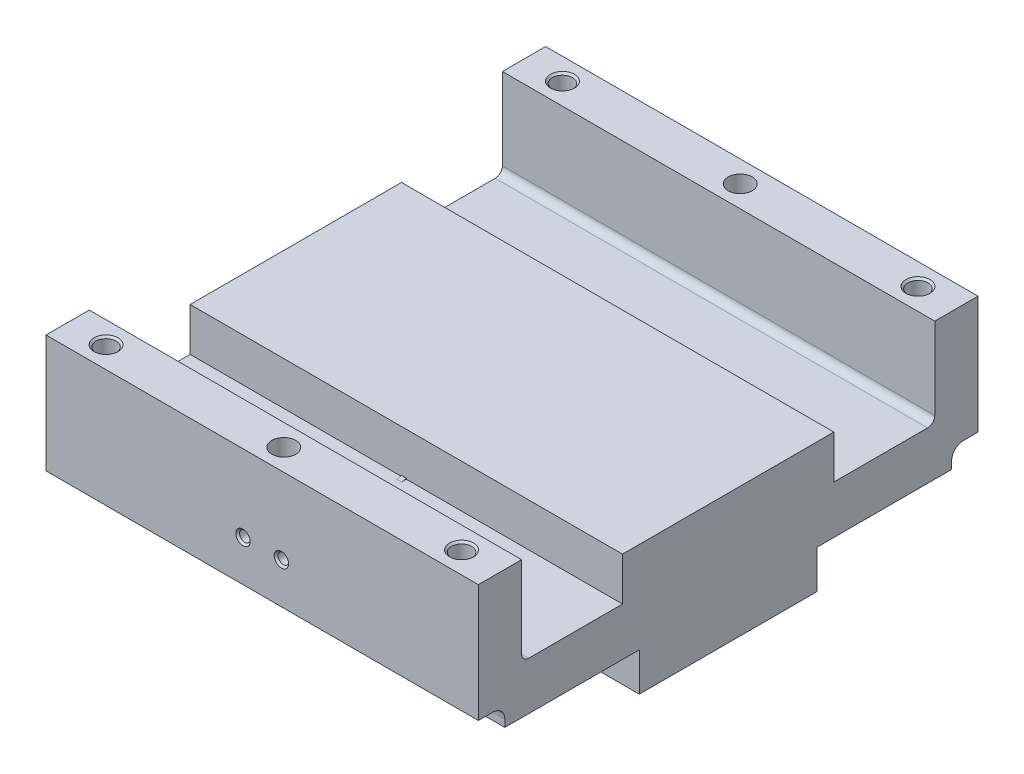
ISO-10303-21;
HEADER;
FILE_DESCRIPTION(('STEP AP214'),'2;1');
FILE_NAME('part.step','',(''),(''),'','','');
FILE_SCHEMA(('AUTOMOTIVE_DESIGN { 1 0 10303 214 1 1 1 1 }'));
ENDSEC;
DATA;
#1=APPLICATION_CONTEXT('core data for automotive mechanical design processes');
#2=APPLICATION_PROTOCOL_DEFINITION('international standard','automotive_design',2000,#1);
#3=PRODUCT_CONTEXT('',#1,'mechanical');
#4=PRODUCT('Part','Part','',(#3));
#5=PRODUCT_RELATED_PRODUCT_CATEGORY('part','',(#4));
#6=PRODUCT_DEFINITION_FORMATION('','',#4);
#7=PRODUCT_DEFINITION_CONTEXT('part definition',#1,'design');
#8=PRODUCT_DEFINITION('design','',#6,#7);
#9=PRODUCT_DEFINITION_SHAPE('','',#8);
#10=(LENGTH_UNIT() NAMED_UNIT(*) SI_UNIT(.MILLI.,.METRE.));
#11=(NAMED_UNIT(*) PLANE_ANGLE_UNIT() SI_UNIT($,.RADIAN.));
#12=(NAMED_UNIT(*) SI_UNIT($,.STERADIAN.) SOLID_ANGLE_UNIT());
#13=UNCERTAINTY_MEASURE_WITH_UNIT(LENGTH_MEASURE(1.E-05),#10,'distance_accuracy_value','');
#14=(GEOMETRIC_REPRESENTATION_CONTEXT(3) GLOBAL_UNCERTAINTY_ASSIGNED_CONTEXT((#13)) GLOBAL_UNIT_ASSIGNED_CONTEXT((#10,
#11,#12)) REPRESENTATION_CONTEXT('',''));
#15=CARTESIAN_POINT('',(0.,0.,0.));
#16=DIRECTION('',(0.,0.,1.));
#17=DIRECTION('',(1.,0.,0.));
#18=AXIS2_PLACEMENT_3D('',#15,#16,#17);
#19=CARTESIAN_POINT('',(-1.29084921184,55.,-49.78518920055));
#20=DIRECTION('',(0.,1.,0.));
#21=DIRECTION('',(0.,0.,1.));
#22=AXIS2_PLACEMENT_3D('',#19,#20,#21);
#23=PLANE('',#22);
#24=CARTESIAN_POINT('',(1.,55.,-47.5));
#25=DIRECTION('',(0.,1.,0.));
#26=DIRECTION('',(-1.,0.,0.));
#27=AXIS2_PLACEMENT_3D('',#24,#25,#26);
#28=CIRCLE('',#27,2.1);
#29=CARTESIAN_POINT('',(-1.1,55.,-47.5));
#30=VERTEX_POINT('',#29);
#31=EDGE_CURVE('E21',#30,#30,#28,.F.);
#32=ORIENTED_EDGE('',*,*,#31,.F.);
#33=EDGE_LOOP('',(#32));
#34=FACE_BOUND('',#33,.T.);
#35=ADVANCED_FACE('F17',(#34),#23,.T.);
#36=CARTESIAN_POINT('',(-75.29084921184,55.,-49.78518920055));
#37=DIRECTION('',(0.,1.,0.));
#38=DIRECTION('',(0.,0.,1.));
#39=AXIS2_PLACEMENT_3D('',#36,#37,#38);
#40=PLANE('',#39);
#41=CARTESIAN_POINT('',(-73.,55.,-47.5));
#42=DIRECTION('',(0.,1.,0.));
#43=DIRECTION('',(-1.,0.,0.));
#44=AXIS2_PLACEMENT_3D('',#41,#42,#43);
#45=CIRCLE('',#44,2.1);
#46=CARTESIAN_POINT('',(-75.1,55.,-47.5));
#47=VERTEX_POINT('',#46);
#48=EDGE_CURVE('E476',#47,#47,#45,.F.);
#49=ORIENTED_EDGE('',*,*,#48,.F.);
#50=EDGE_LOOP('',(#49));
#51=FACE_BOUND('',#50,.T.);
#52=ADVANCED_FACE('F487',(#51),#40,.T.);
#53=CARTESIAN_POINT('',(-75.29084921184,55.,45.21481079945));
#54=DIRECTION('',(0.,1.,0.));
#55=DIRECTION('',(0.,0.,1.));
#56=AXIS2_PLACEMENT_3D('',#53,#54,#55);
#57=PLANE('',#56);
#58=CARTESIAN_POINT('',(-73.,55.,47.5));
#59=DIRECTION('',(0.,1.,0.));
#60=DIRECTION('',(-1.,0.,0.));
#61=AXIS2_PLACEMENT_3D('',#58,#59,#60);
#62=CIRCLE('',#61,2.1);
#63=CARTESIAN_POINT('',(-75.1,55.,47.5));
#64=VERTEX_POINT('',#63);
#65=EDGE_CURVE('E474',#64,#64,#62,.F.);
#66=ORIENTED_EDGE('',*,*,#65,.F.);
#67=EDGE_LOOP('',(#66));
#68=FACE_BOUND('',#67,.T.);
#69=ADVANCED_FACE('F493',(#68),#57,.T.);
#70=CARTESIAN_POINT('',(-1.29084921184,55.,45.21481079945));
#71=DIRECTION('',(0.,1.,0.));
#72=DIRECTION('',(0.,0.,1.));
#73=AXIS2_PLACEMENT_3D('',#70,#71,#72);
#74=PLANE('',#73);
#75=CARTESIAN_POINT('',(1.,55.,47.5));
#76=DIRECTION('',(0.,1.,0.));
#77=DIRECTION('',(-1.,0.,0.));
#78=AXIS2_PLACEMENT_3D('',#75,#76,#77);
#79=CIRCLE('',#78,2.1);
#80=CARTESIAN_POINT('',(-1.1,55.,47.5));
#81=VERTEX_POINT('',#80);
#82=EDGE_CURVE('E471',#81,#81,#79,.F.);
#83=ORIENTED_EDGE('',*,*,#82,.F.);
#84=EDGE_LOOP('',(#83));
#85=FACE_BOUND('',#84,.T.);
#86=ADVANCED_FACE('F863',(#85),#74,.T.);
#87=CARTESIAN_POINT('',(-30.71057515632,55.28518920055,44.));
#88=DIRECTION('',(0.,0.,-1.));
#89=DIRECTION('',(0.,-1.,0.));
#90=AXIS2_PLACEMENT_3D('',#87,#88,#89);
#91=PLANE('',#90);
#92=CARTESIAN_POINT('',(-32.,54.,43.9999999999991));
#93=DIRECTION('',(0.,0.,1.));
#94=DIRECTION('',(1.,0.,0.));
#95=AXIS2_PLACEMENT_3D('',#92,#93,#94);
#96=CIRCLE('',#95,1.1);
#97=CARTESIAN_POINT('',(-30.9,54.,43.9999999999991));
#98=VERTEX_POINT('',#97);
#99=EDGE_CURVE('E468',#98,#98,#96,.F.);
#100=ORIENTED_EDGE('',*,*,#99,.F.);
#101=EDGE_LOOP('',(#100));
#102=FACE_BOUND('',#101,.T.);
#103=ADVANCED_FACE('F859',(#102),#91,.F.);
#104=CARTESIAN_POINT('',(-38.71057515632,55.28518920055,44.));
#105=DIRECTION('',(0.,0.,-1.));
#106=DIRECTION('',(0.,-1.,0.));
#107=AXIS2_PLACEMENT_3D('',#104,#105,#106);
#108=PLANE('',#107);
#109=CARTESIAN_POINT('',(-40.,54.,43.9999999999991));
#110=DIRECTION('',(0.,0.,1.));
#111=DIRECTION('',(1.,0.,0.));
#112=AXIS2_PLACEMENT_3D('',#109,#110,#111);
#113=CIRCLE('',#112,1.1);
#114=CARTESIAN_POINT('',(-38.9,54.,43.9999999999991));
#115=VERTEX_POINT('',#114);
#116=EDGE_CURVE('E465',#115,#115,#113,.F.);
#117=ORIENTED_EDGE('',*,*,#116,.F.);
#118=EDGE_LOOP('',(#117));
#119=FACE_BOUND('',#118,.T.);
#120=ADVANCED_FACE('F855',(#119),#108,.F.);
#121=CARTESIAN_POINT('',(-38.71057515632,55.28518920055,-44.));
#122=DIRECTION('',(0.,0.,-1.));
#123=DIRECTION('',(0.,-1.,0.));
#124=AXIS2_PLACEMENT_3D('',#121,#122,#123);
#125=PLANE('',#124);
#126=CARTESIAN_POINT('',(-40.,54.,-43.9999999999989));
#127=DIRECTION('',(0.,0.,1.));
#128=DIRECTION('',(1.,0.,0.));
#129=AXIS2_PLACEMENT_3D('',#126,#127,#128);
#130=CIRCLE('',#129,1.1);
#131=CARTESIAN_POINT('',(-38.9,54.,-43.9999999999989));
#132=VERTEX_POINT('',#131);
#133=EDGE_CURVE('E462',#132,#132,#130,.T.);
#134=ORIENTED_EDGE('',*,*,#133,.F.);
#135=EDGE_LOOP('',(#134));
#136=FACE_BOUND('',#135,.T.);
#137=ADVANCED_FACE('F851',(#136),#125,.T.);
#138=CARTESIAN_POINT('',(-30.71057515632,55.28518920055,-44.));
#139=DIRECTION('',(0.,0.,-1.));
#140=DIRECTION('',(0.,-1.,0.));
#141=AXIS2_PLACEMENT_3D('',#138,#139,#140);
#142=PLANE('',#141);
#143=CARTESIAN_POINT('',(-32.,54.,-43.9999999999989));
#144=DIRECTION('',(0.,0.,1.));
#145=DIRECTION('',(1.,0.,0.));
#146=AXIS2_PLACEMENT_3D('',#143,#144,#145);
#147=CIRCLE('',#146,1.1);
#148=CARTESIAN_POINT('',(-30.9,54.,-43.9999999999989));
#149=VERTEX_POINT('',#148);
#150=EDGE_CURVE('E459',#149,#149,#147,.T.);
#151=ORIENTED_EDGE('',*,*,#150,.F.);
#152=EDGE_LOOP('',(#151));
#153=FACE_BOUND('',#152,.T.);
#154=ADVANCED_FACE('F847',(#153),#142,.T.);
#155=CARTESIAN_POINT('',(-38.69192730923,58.,-50.18518920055));
#156=DIRECTION('',(0.,1.,0.));
#157=DIRECTION('',(0.,0.,1.));
#158=AXIS2_PLACEMENT_3D('',#155,#156,#157);
#159=PLANE('',#158);
#160=CARTESIAN_POINT('',(-36.,58.,-47.5));
#161=DIRECTION('',(0.,1.,0.));
#162=DIRECTION('',(-1.,0.,0.));
#163=AXIS2_PLACEMENT_3D('',#160,#161,#162);
#164=CIRCLE('',#163,2.5);
#165=CARTESIAN_POINT('',(-38.5,58.,-47.5));
#166=VERTEX_POINT('',#165);
#167=EDGE_CURVE('E382',#166,#166,#164,.F.);
#168=ORIENTED_EDGE('',*,*,#167,.F.);
#169=EDGE_LOOP('',(#168));
#170=FACE_BOUND('',#169,.T.);
#171=ADVANCED_FACE('F844',(#170),#159,.T.);
#172=CARTESIAN_POINT('',(1.,55.,-47.5));
#173=DIRECTION('',(0.,1.,0.));
#174=DIRECTION('',(-1.,0.,0.));
#175=AXIS2_PLACEMENT_3D('',#172,#173,#174);
#176=CYLINDRICAL_SURFACE('',#175,2.1);
#177=ORIENTED_EDGE('',*,*,#31,.T.);
#178=EDGE_LOOP('',(#177));
#179=FACE_BOUND('',#178,.T.);
#180=CARTESIAN_POINT('',(1.,69.6000000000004,-47.5));
#181=DIRECTION('',(0.,1.,0.));
#182=DIRECTION('',(-1.,0.,0.));
#183=AXIS2_PLACEMENT_3D('',#180,#181,#182);
#184=CIRCLE('',#183,2.09999999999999);
#185=CARTESIAN_POINT('',(-1.09999999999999,69.6000000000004,-47.5));
#186=VERTEX_POINT('',#185);
#187=EDGE_CURVE('E379',#186,#186,#184,.F.);
#188=ORIENTED_EDGE('',*,*,#187,.F.);
#189=EDGE_LOOP('',(#188));
#190=FACE_BOUND('',#189,.T.);
#191=ADVANCED_FACE('F483',(#179,#190),#176,.F.);
#192=CARTESIAN_POINT('',(-73.,55.,-47.5));
#193=DIRECTION('',(0.,1.,0.));
#194=DIRECTION('',(-1.,0.,0.));
#195=AXIS2_PLACEMENT_3D('',#192,#193,#194);
#196=CYLINDRICAL_SURFACE('',#195,2.1);
#197=ORIENTED_EDGE('',*,*,#48,.T.);
#198=EDGE_LOOP('',(#197));
#199=FACE_BOUND('',#198,.T.);
#200=CARTESIAN_POINT('',(-73.,69.6000000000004,-47.5));
#201=DIRECTION('',(0.,1.,0.));
#202=DIRECTION('',(-1.,0.,0.));
#203=AXIS2_PLACEMENT_3D('',#200,#201,#202);
#204=CIRCLE('',#203,2.10000000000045);
#205=CARTESIAN_POINT('',(-75.1000000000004,69.6000000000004,-47.5));
#206=VERTEX_POINT('',#205);
#207=EDGE_CURVE('E375',#206,#206,#204,.F.);
#208=ORIENTED_EDGE('',*,*,#207,.F.);
#209=EDGE_LOOP('',(#208));
#210=FACE_BOUND('',#209,.T.);
#211=ADVANCED_FACE('F842',(#199,#210),#196,.F.);
#212=CARTESIAN_POINT('',(-38.69192730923,58.,44.81481079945));
#213=DIRECTION('',(0.,1.,0.));
#214=DIRECTION('',(0.,0.,1.));
#215=AXIS2_PLACEMENT_3D('',#212,#213,#214);
#216=PLANE('',#215);
#217=CARTESIAN_POINT('',(-36.,58.,47.5));
#218=DIRECTION('',(0.,1.,0.));
#219=DIRECTION('',(-1.,0.,0.));
#220=AXIS2_PLACEMENT_3D('',#217,#218,#219);
#221=CIRCLE('',#220,2.5);
#222=CARTESIAN_POINT('',(-38.5,58.,47.5));
#223=VERTEX_POINT('',#222);
#224=EDGE_CURVE('E374',#223,#223,#221,.F.);
#225=ORIENTED_EDGE('',*,*,#224,.F.);
#226=EDGE_LOOP('',(#225));
#227=FACE_BOUND('',#226,.T.);
#228=ADVANCED_FACE('F838',(#227),#216,.T.);
#229=CARTESIAN_POINT('',(-73.,55.,47.5));
#230=DIRECTION('',(0.,1.,0.));
#231=DIRECTION('',(-1.,0.,0.));
#232=AXIS2_PLACEMENT_3D('',#229,#230,#231);
#233=CYLINDRICAL_SURFACE('',#232,2.1);
#234=ORIENTED_EDGE('',*,*,#65,.T.);
#235=EDGE_LOOP('',(#234));
#236=FACE_BOUND('',#235,.T.);
#237=CARTESIAN_POINT('',(-73.,69.6000000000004,47.5));
#238=DIRECTION('',(0.,1.,0.));
#239=DIRECTION('',(-1.,0.,0.));
#240=AXIS2_PLACEMENT_3D('',#237,#238,#239);
#241=CIRCLE('',#240,2.10000000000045);
#242=CARTESIAN_POINT('',(-75.1000000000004,69.6000000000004,47.5));
#243=VERTEX_POINT('',#242);
#244=EDGE_CURVE('E371',#243,#243,#241,.F.);
#245=ORIENTED_EDGE('',*,*,#244,.F.);
#246=EDGE_LOOP('',(#245));
#247=FACE_BOUND('',#246,.T.);
#248=ADVANCED_FACE('F841',(#236,#247),#233,.F.);
#249=CARTESIAN_POINT('',(1.,55.,47.5));
#250=DIRECTION('',(0.,1.,0.));
#251=DIRECTION('',(-1.,0.,0.));
#252=AXIS2_PLACEMENT_3D('',#249,#250,#251);
#253=CYLINDRICAL_SURFACE('',#252,2.1);
#254=ORIENTED_EDGE('',*,*,#82,.T.);
#255=EDGE_LOOP('',(#254));
#256=FACE_BOUND('',#255,.T.);
#257=CARTESIAN_POINT('',(1.,69.6000000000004,47.5));
#258=DIRECTION('',(0.,1.,0.));
#259=DIRECTION('',(-1.,0.,0.));
#260=AXIS2_PLACEMENT_3D('',#257,#258,#259);
#261=CIRCLE('',#260,2.09999999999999);
#262=CARTESIAN_POINT('',(-1.09999999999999,69.6000000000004,47.5));
#263=VERTEX_POINT('',#262);
#264=EDGE_CURVE('E368',#263,#263,#261,.F.);
#265=ORIENTED_EDGE('',*,*,#264,.F.);
#266=EDGE_LOOP('',(#265));
#267=FACE_BOUND('',#266,.T.);
#268=ADVANCED_FACE('F876',(#256,#267),#253,.F.);
#269=CARTESIAN_POINT('',(-32.,54.,43.9999999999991));
#270=DIRECTION('',(0.,0.,1.));
#271=DIRECTION('',(1.,0.,0.));
#272=AXIS2_PLACEMENT_3D('',#269,#270,#271);
#273=CYLINDRICAL_SURFACE('',#272,1.1);
#274=ORIENTED_EDGE('',*,*,#99,.T.);
#275=EDGE_LOOP('',(#274));
#276=FACE_BOUND('',#275,.T.);
#277=CARTESIAN_POINT('',(-32.,54.,51.6000000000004));
#278=DIRECTION('',(0.,0.,1.));
#279=DIRECTION('',(-1.,0.,0.));
#280=AXIS2_PLACEMENT_3D('',#277,#278,#279);
#281=CIRCLE('',#280,1.10000000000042);
#282=CARTESIAN_POINT('',(-33.1000000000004,54.,51.6000000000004));
#283=VERTEX_POINT('',#282);
#284=EDGE_CURVE('E365',#283,#283,#281,.F.);
#285=ORIENTED_EDGE('',*,*,#284,.F.);
#286=EDGE_LOOP('',(#285));
#287=FACE_BOUND('',#286,.T.);
#288=ADVANCED_FACE('F972',(#276,#287),#273,.F.);
#289=CARTESIAN_POINT('',(-40.,54.,43.9999999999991));
#290=DIRECTION('',(0.,0.,1.));
#291=DIRECTION('',(1.,0.,0.));
#292=AXIS2_PLACEMENT_3D('',#289,#290,#291);
#293=CYLINDRICAL_SURFACE('',#292,1.1);
#294=ORIENTED_EDGE('',*,*,#116,.T.);
#295=EDGE_LOOP('',(#294));
#296=FACE_BOUND('',#295,.T.);
#297=CARTESIAN_POINT('',(-40.,54.,51.6000000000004));
#298=DIRECTION('',(0.,0.,1.));
#299=DIRECTION('',(-1.,0.,0.));
#300=AXIS2_PLACEMENT_3D('',#297,#298,#299);
#301=CIRCLE('',#300,1.10000000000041);
#302=CARTESIAN_POINT('',(-41.1000000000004,54.,51.6000000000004));
#303=VERTEX_POINT('',#302);
#304=EDGE_CURVE('E284',#303,#303,#301,.F.);
#305=ORIENTED_EDGE('',*,*,#304,.F.);
#306=EDGE_LOOP('',(#305));
#307=FACE_BOUND('',#306,.T.);
#308=ADVANCED_FACE('F968',(#296,#307),#293,.F.);
#309=CARTESIAN_POINT('',(-40.,54.,-51.6000000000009));
#310=DIRECTION('',(0.,0.,1.));
#311=DIRECTION('',(1.,0.,0.));
#312=AXIS2_PLACEMENT_3D('',#309,#310,#311);
#313=CYLINDRICAL_SURFACE('',#312,1.1);
#314=ORIENTED_EDGE('',*,*,#133,.T.);
#315=EDGE_LOOP('',(#314));
#316=FACE_BOUND('',#315,.T.);
#317=CARTESIAN_POINT('',(-40.,54.,-51.6000000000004));
#318=DIRECTION('',(0.,0.,-1.));
#319=DIRECTION('',(-1.,0.,0.));
#320=AXIS2_PLACEMENT_3D('',#317,#318,#319);
#321=CIRCLE('',#320,1.10000000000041);
#322=CARTESIAN_POINT('',(-41.1000000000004,54.,-51.6000000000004));
#323=VERTEX_POINT('',#322);
#324=EDGE_CURVE('E288',#323,#323,#321,.F.);
#325=ORIENTED_EDGE('',*,*,#324,.F.);
#326=EDGE_LOOP('',(#325));
#327=FACE_BOUND('',#326,.T.);
#328=ADVANCED_FACE('F964',(#316,#327),#313,.F.);
#329=CARTESIAN_POINT('',(-32.,54.,-51.6000000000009));
#330=DIRECTION('',(0.,0.,1.));
#331=DIRECTION('',(1.,0.,0.));
#332=AXIS2_PLACEMENT_3D('',#329,#330,#331);
#333=CYLINDRICAL_SURFACE('',#332,1.1);
#334=ORIENTED_EDGE('',*,*,#150,.T.);
#335=EDGE_LOOP('',(#334));
#336=FACE_BOUND('',#335,.T.);
#337=CARTESIAN_POINT('',(-32.,54.,-51.6000000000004));
#338=DIRECTION('',(0.,0.,-1.));
#339=DIRECTION('',(-1.,0.,0.));
#340=AXIS2_PLACEMENT_3D('',#337,#338,#339);
#341=CIRCLE('',#340,1.10000000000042);
#342=CARTESIAN_POINT('',(-33.1000000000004,54.,-51.6000000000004));
#343=VERTEX_POINT('',#342);
#344=EDGE_CURVE('E346',#343,#343,#341,.F.);
#345=ORIENTED_EDGE('',*,*,#344,.F.);
#346=EDGE_LOOP('',(#345));
#347=FACE_BOUND('',#346,.T.);
#348=ADVANCED_FACE('F960',(#336,#347),#333,.F.);
#349=CARTESIAN_POINT('',(-36.,58.,-47.5));
#350=DIRECTION('',(0.,1.,0.));
#351=DIRECTION('',(-1.,0.,0.));
#352=AXIS2_PLACEMENT_3D('',#349,#350,#351);
#353=CYLINDRICAL_SURFACE('',#352,2.5);
#354=ORIENTED_EDGE('',*,*,#167,.T.);
#355=EDGE_LOOP('',(#354));
#356=FACE_BOUND('',#355,.T.);
#357=CARTESIAN_POINT('',(-36.,69.9999999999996,-47.5));
#358=DIRECTION('',(0.,1.,0.));
#359=DIRECTION('',(-1.,0.,0.));
#360=AXIS2_PLACEMENT_3D('',#357,#358,#359);
#361=CIRCLE('',#360,2.5);
#362=CARTESIAN_POINT('',(-38.5,69.9999999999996,-47.5));
#363=VERTEX_POINT('',#362);
#364=EDGE_CURVE('E442',#363,#363,#361,.F.);
#365=ORIENTED_EDGE('',*,*,#364,.F.);
#366=EDGE_LOOP('',(#365));
#367=FACE_BOUND('',#366,.T.);
#368=ADVANCED_FACE('F956',(#356,#367),#353,.F.);
#369=CARTESIAN_POINT('',(1.,69.6000000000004,-47.5));
#370=DIRECTION('',(0.,1.,0.));
#371=DIRECTION('',(0.,0.,1.));
#372=AXIS2_PLACEMENT_3D('',#369,#370,#371);
#373=CONICAL_SURFACE('',#372,2.09999999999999,0.785398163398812);
#374=ORIENTED_EDGE('',*,*,#187,.T.);
#375=EDGE_LOOP('',(#374));
#376=FACE_BOUND('',#375,.T.);
#377=CARTESIAN_POINT('',(1.,69.9999999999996,-47.5));
#378=DIRECTION('',(0.,1.,0.));
#379=DIRECTION('',(0.,0.,1.));
#380=AXIS2_PLACEMENT_3D('',#377,#378,#379);
#381=CIRCLE('',#380,2.5000000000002);
#382=CARTESIAN_POINT('',(1.,69.9999999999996,-44.9999999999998));
#383=VERTEX_POINT('',#382);
#384=EDGE_CURVE('E439',#383,#383,#381,.F.);
#385=ORIENTED_EDGE('',*,*,#384,.F.);
#386=EDGE_LOOP('',(#385));
#387=FACE_BOUND('',#386,.T.);
#388=ADVANCED_FACE('F952',(#376,#387),#373,.F.);
#389=CARTESIAN_POINT('',(-73.,69.6000000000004,-47.5));
#390=DIRECTION('',(0.,1.,0.));
#391=DIRECTION('',(0.,0.,1.));
#392=AXIS2_PLACEMENT_3D('',#389,#390,#391);
#393=CONICAL_SURFACE('',#392,2.10000000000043,0.785398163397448);
#394=ORIENTED_EDGE('',*,*,#207,.T.);
#395=EDGE_LOOP('',(#394));
#396=FACE_BOUND('',#395,.T.);
#397=CARTESIAN_POINT('',(-73.,69.9999999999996,-47.5));
#398=DIRECTION('',(0.,1.,0.));
#399=DIRECTION('',(0.,0.,1.));
#400=AXIS2_PLACEMENT_3D('',#397,#398,#399);
#401=CIRCLE('',#400,2.49999999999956);
#402=CARTESIAN_POINT('',(-73.,69.9999999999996,-45.0000000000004));
#403=VERTEX_POINT('',#402);
#404=EDGE_CURVE('E435',#403,#403,#401,.F.);
#405=ORIENTED_EDGE('',*,*,#404,.F.);
#406=EDGE_LOOP('',(#405));
#407=FACE_BOUND('',#406,.T.);
#408=ADVANCED_FACE('F836',(#396,#407),#393,.F.);
#409=CARTESIAN_POINT('',(-36.,51.4965685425,-21.81481079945));
#410=DIRECTION('',(1.,0.,0.));
#411=DIRECTION('',(0.,0.,-1.));
#412=AXIS2_PLACEMENT_3D('',#409,#410,#411);
#413=PLANE('',#412);
#414=CARTESIAN_POINT('',(-35.9999999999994,54.5,-23.));
#415=DIRECTION('',(-1.,0.,0.));
#416=DIRECTION('',(0.,0.,1.));
#417=AXIS2_PLACEMENT_3D('',#414,#415,#416);
#418=CIRCLE('',#417,3.);
#419=CARTESIAN_POINT('',(-35.9999999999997,51.6715728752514,-22.));
#420=VERTEX_POINT('',#419);
#421=CARTESIAN_POINT('',(-35.9999999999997,51.5,-23.));
#422=VERTEX_POINT('',#421);
#423=EDGE_CURVE('E378',#420,#422,#418,.F.);
#424=ORIENTED_EDGE('',*,*,#423,.F.);
#425=DIRECTION('',(0.,1.,0.));
#426=VECTOR('',#425,1.);
#427=CARTESIAN_POINT('',(-36.,56.,-22.));
#428=LINE('',#427,#426);
#429=CARTESIAN_POINT('',(-36.,51.4999999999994,-22.));
#430=VERTEX_POINT('',#429);
#431=EDGE_CURVE('E98',#430,#420,#428,.T.);
#432=ORIENTED_EDGE('',*,*,#431,.F.);
#433=DIRECTION('',(0.,0.,1.));
#434=VECTOR('',#433,1.);
#435=CARTESIAN_POINT('',(-36.,51.5,-31.75));
#436=LINE('',#435,#434);
#437=EDGE_CURVE('E106',#422,#430,#436,.T.);
#438=ORIENTED_EDGE('',*,*,#437,.F.);
#439=EDGE_LOOP('',(#424,#432,#438));
#440=FACE_BOUND('',#439,.T.);
#441=ADVANCED_FACE('F833',(#440),#413,.T.);
#442=CARTESIAN_POINT('',(-35.9999999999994,54.5,-23.));
#443=DIRECTION('',(-1.,0.,0.));
#444=DIRECTION('',(0.,0.,1.));
#445=AXIS2_PLACEMENT_3D('',#442,#443,#444);
#446=CYLINDRICAL_SURFACE('',#445,3.);
#447=DIRECTION('',(-1.,0.,0.));
#448=VECTOR('',#447,1.);
#449=CARTESIAN_POINT('',(-36.,51.6715728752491,-22.));
#450=LINE('',#449,#448);
#451=CARTESIAN_POINT('',(-37.0000000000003,51.6715728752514,-22.));
#452=VERTEX_POINT('',#451);
#453=EDGE_CURVE('E322',#420,#452,#450,.T.);
#454=ORIENTED_EDGE('',*,*,#453,.F.);
#455=ORIENTED_EDGE('',*,*,#423,.T.);
#456=DIRECTION('',(1.,0.,0.));
#457=VECTOR('',#456,1.);
#458=CARTESIAN_POINT('',(-36.,51.5,-23.));
#459=LINE('',#458,#457);
#460=CARTESIAN_POINT('',(-37.0000000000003,51.5,-23.));
#461=VERTEX_POINT('',#460);
#462=EDGE_CURVE('E318',#461,#422,#459,.T.);
#463=ORIENTED_EDGE('',*,*,#462,.F.);
#464=CARTESIAN_POINT('',(-37.0000000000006,54.5,-23.));
#465=DIRECTION('',(-1.,0.,0.));
#466=DIRECTION('',(0.,0.,1.));
#467=AXIS2_PLACEMENT_3D('',#464,#465,#466);
#468=CIRCLE('',#467,3.);
#469=EDGE_CURVE('E453',#461,#452,#468,.T.);
#470=ORIENTED_EDGE('',*,*,#469,.T.);
#471=EDGE_LOOP('',(#454,#455,#463,#470));
#472=FACE_BOUND('',#471,.T.);
#473=ADVANCED_FACE('F831',(#472),#446,.F.);
#474=CARTESIAN_POINT('',(-37.,51.49656854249,-21.81481079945));
#475=DIRECTION('',(1.,0.,0.));
#476=DIRECTION('',(0.,0.,-1.));
#477=AXIS2_PLACEMENT_3D('',#474,#475,#476);
#478=PLANE('',#477);
#479=ORIENTED_EDGE('',*,*,#469,.F.);
#480=DIRECTION('',(0.,0.,-1.));
#481=VECTOR('',#480,1.);
#482=CARTESIAN_POINT('',(-37.,51.5,-31.75));
#483=LINE('',#482,#481);
#484=CARTESIAN_POINT('',(-37.,51.4999999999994,-22.));
#485=VERTEX_POINT('',#484);
#486=EDGE_CURVE('E323',#485,#461,#483,.T.);
#487=ORIENTED_EDGE('',*,*,#486,.F.);
#488=DIRECTION('',(0.,-1.,0.));
#489=VECTOR('',#488,1.);
#490=CARTESIAN_POINT('',(-37.,56.,-22.));
#491=LINE('',#490,#489);
#492=EDGE_CURVE('E330',#452,#485,#491,.T.);
#493=ORIENTED_EDGE('',*,*,#492,.F.);
#494=EDGE_LOOP('',(#479,#487,#493));
#495=FACE_BOUND('',#494,.T.);
#496=ADVANCED_FACE('F827',(#495),#478,.F.);
#497=CARTESIAN_POINT('',(-36.,51.4965685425,23.18518920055));
#498=DIRECTION('',(1.,0.,0.));
#499=DIRECTION('',(0.,0.,-1.));
#500=AXIS2_PLACEMENT_3D('',#497,#498,#499);
#501=PLANE('',#500);
#502=CARTESIAN_POINT('',(-35.9999999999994,54.5,23.));
#503=DIRECTION('',(-1.,0.,0.));
#504=DIRECTION('',(0.,0.,1.));
#505=AXIS2_PLACEMENT_3D('',#502,#503,#504);
#506=CIRCLE('',#505,3.);
#507=CARTESIAN_POINT('',(-35.9999999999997,51.5,23.));
#508=VERTEX_POINT('',#507);
#509=CARTESIAN_POINT('',(-35.9999999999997,51.6715728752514,22.));
#510=VERTEX_POINT('',#509);
#511=EDGE_CURVE('E451',#508,#510,#506,.F.);
#512=ORIENTED_EDGE('',*,*,#511,.F.);
#513=DIRECTION('',(0.,0.,1.));
#514=VECTOR('',#513,1.);
#515=CARTESIAN_POINT('',(-36.,51.5,31.75));
#516=LINE('',#515,#514);
#517=CARTESIAN_POINT('',(-36.,51.4999999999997,22.));
#518=VERTEX_POINT('',#517);
#519=EDGE_CURVE('E305',#518,#508,#516,.T.);
#520=ORIENTED_EDGE('',*,*,#519,.F.);
#521=DIRECTION('',(0.,1.,0.));
#522=VECTOR('',#521,1.);
#523=CARTESIAN_POINT('',(-36.,56.,22.));
#524=LINE('',#523,#522);
#525=EDGE_CURVE('E310',#518,#510,#524,.T.);
#526=ORIENTED_EDGE('',*,*,#525,.T.);
#527=EDGE_LOOP('',(#512,#520,#526));
#528=FACE_BOUND('',#527,.T.);
#529=ADVANCED_FACE('F824',(#528),#501,.T.);
#530=CARTESIAN_POINT('',(-35.9999999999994,54.5,23.));
#531=DIRECTION('',(-1.,0.,0.));
#532=DIRECTION('',(0.,0.,1.));
#533=AXIS2_PLACEMENT_3D('',#530,#531,#532);
#534=CYLINDRICAL_SURFACE('',#533,3.);
#535=DIRECTION('',(-1.,0.,0.));
#536=VECTOR('',#535,1.);
#537=CARTESIAN_POINT('',(-36.,51.6715728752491,22.));
#538=LINE('',#537,#536);
#539=CARTESIAN_POINT('',(-37.0000000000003,51.6715728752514,22.));
#540=VERTEX_POINT('',#539);
#541=EDGE_CURVE('E295',#510,#540,#538,.T.);
#542=ORIENTED_EDGE('',*,*,#541,.T.);
#543=CARTESIAN_POINT('',(-37.0000000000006,54.5,23.));
#544=DIRECTION('',(-1.,0.,0.));
#545=DIRECTION('',(0.,0.,1.));
#546=AXIS2_PLACEMENT_3D('',#543,#544,#545);
#547=CIRCLE('',#546,3.);
#548=CARTESIAN_POINT('',(-37.0000000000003,51.5,23.));
#549=VERTEX_POINT('',#548);
#550=EDGE_CURVE('E448',#540,#549,#547,.T.);
#551=ORIENTED_EDGE('',*,*,#550,.T.);
#552=DIRECTION('',(-1.,0.,0.));
#553=VECTOR('',#552,1.);
#554=CARTESIAN_POINT('',(-36.,51.5,23.));
#555=LINE('',#554,#553);
#556=EDGE_CURVE('E301',#508,#549,#555,.T.);
#557=ORIENTED_EDGE('',*,*,#556,.F.);
#558=ORIENTED_EDGE('',*,*,#511,.T.);
#559=EDGE_LOOP('',(#542,#551,#557,#558));
#560=FACE_BOUND('',#559,.T.);
#561=ADVANCED_FACE('F822',(#560),#534,.F.);
#562=CARTESIAN_POINT('',(-37.,51.49656854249,23.18518920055));
#563=DIRECTION('',(1.,0.,0.));
#564=DIRECTION('',(0.,0.,-1.));
#565=AXIS2_PLACEMENT_3D('',#562,#563,#564);
#566=PLANE('',#565);
#567=ORIENTED_EDGE('',*,*,#550,.F.);
#568=DIRECTION('',(0.,-1.,0.));
#569=VECTOR('',#568,1.);
#570=CARTESIAN_POINT('',(-37.,56.,22.));
#571=LINE('',#570,#569);
#572=CARTESIAN_POINT('',(-37.,51.5,22.));
#573=VERTEX_POINT('',#572);
#574=EDGE_CURVE('E291',#540,#573,#571,.T.);
#575=ORIENTED_EDGE('',*,*,#574,.T.);
#576=DIRECTION('',(0.,0.,-1.));
#577=VECTOR('',#576,1.);
#578=CARTESIAN_POINT('',(-37.,51.5,31.75));
#579=LINE('',#578,#577);
#580=EDGE_CURVE('E298',#549,#573,#579,.T.);
#581=ORIENTED_EDGE('',*,*,#580,.F.);
#582=EDGE_LOOP('',(#567,#575,#581));
#583=FACE_BOUND('',#582,.T.);
#584=ADVANCED_FACE('F818',(#583),#566,.F.);
#585=CARTESIAN_POINT('',(-36.,58.,47.5));
#586=DIRECTION('',(0.,1.,0.));
#587=DIRECTION('',(-1.,0.,0.));
#588=AXIS2_PLACEMENT_3D('',#585,#586,#587);
#589=CYLINDRICAL_SURFACE('',#588,2.5);
#590=ORIENTED_EDGE('',*,*,#224,.T.);
#591=EDGE_LOOP('',(#590));
#592=FACE_BOUND('',#591,.T.);
#593=CARTESIAN_POINT('',(-36.,69.9999999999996,47.5));
#594=DIRECTION('',(0.,1.,0.));
#595=DIRECTION('',(-1.,0.,0.));
#596=AXIS2_PLACEMENT_3D('',#593,#594,#595);
#597=CIRCLE('',#596,2.5);
#598=CARTESIAN_POINT('',(-38.5,69.9999999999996,47.5));
#599=VERTEX_POINT('',#598);
#600=EDGE_CURVE('E431',#599,#599,#597,.F.);
#601=ORIENTED_EDGE('',*,*,#600,.F.);
#602=EDGE_LOOP('',(#601));
#603=FACE_BOUND('',#602,.T.);
#604=ADVANCED_FACE('F821',(#592,#603),#589,.F.);
#605=CARTESIAN_POINT('',(-73.,69.6000000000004,47.5));
#606=DIRECTION('',(0.,1.,0.));
#607=DIRECTION('',(0.,0.,1.));
#608=AXIS2_PLACEMENT_3D('',#605,#606,#607);
#609=CONICAL_SURFACE('',#608,2.10000000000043,0.785398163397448);
#610=ORIENTED_EDGE('',*,*,#244,.T.);
#611=EDGE_LOOP('',(#610));
#612=FACE_BOUND('',#611,.T.);
#613=CARTESIAN_POINT('',(-73.,69.9999999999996,47.5));
#614=DIRECTION('',(0.,1.,0.));
#615=DIRECTION('',(0.,0.,1.));
#616=AXIS2_PLACEMENT_3D('',#613,#614,#615);
#617=CIRCLE('',#616,2.49999999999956);
#618=CARTESIAN_POINT('',(-73.,69.9999999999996,49.9999999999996));
#619=VERTEX_POINT('',#618);
#620=EDGE_CURVE('E428',#619,#619,#617,.F.);
#621=ORIENTED_EDGE('',*,*,#620,.F.);
#622=EDGE_LOOP('',(#621));
#623=FACE_BOUND('',#622,.T.);
#624=ADVANCED_FACE('F880',(#612,#623),#609,.F.);
#625=CARTESIAN_POINT('',(1.,69.6000000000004,47.5));
#626=DIRECTION('',(0.,1.,0.));
#627=DIRECTION('',(0.,0.,1.));
#628=AXIS2_PLACEMENT_3D('',#625,#626,#627);
#629=CONICAL_SURFACE('',#628,2.09999999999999,0.785398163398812);
#630=ORIENTED_EDGE('',*,*,#264,.T.);
#631=EDGE_LOOP('',(#630));
#632=FACE_BOUND('',#631,.T.);
#633=CARTESIAN_POINT('',(1.,69.9999999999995,47.5));
#634=DIRECTION('',(0.,1.,0.));
#635=DIRECTION('',(0.,0.,1.));
#636=AXIS2_PLACEMENT_3D('',#633,#634,#635);
#637=CIRCLE('',#636,2.5000000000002);
#638=CARTESIAN_POINT('',(1.,69.9999999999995,50.0000000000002));
#639=VERTEX_POINT('',#638);
#640=EDGE_CURVE('E425',#639,#639,#637,.F.);
#641=ORIENTED_EDGE('',*,*,#640,.F.);
#642=EDGE_LOOP('',(#641));
#643=FACE_BOUND('',#642,.T.);
#644=ADVANCED_FACE('F883',(#632,#643),#629,.F.);
#645=CARTESIAN_POINT('',(-32.,54.,51.6000000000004));
#646=DIRECTION('',(0.,0.,1.));
#647=DIRECTION('',(0.,-1.,0.));
#648=AXIS2_PLACEMENT_3D('',#645,#646,#647);
#649=CONICAL_SURFACE('',#648,1.10000000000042,0.785398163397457);
#650=ORIENTED_EDGE('',*,*,#284,.T.);
#651=EDGE_LOOP('',(#650));
#652=FACE_BOUND('',#651,.T.);
#653=CARTESIAN_POINT('',(-32.,54.,51.9999999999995));
#654=DIRECTION('',(0.,0.,1.));
#655=DIRECTION('',(0.,-1.,0.));
#656=AXIS2_PLACEMENT_3D('',#653,#654,#655);
#657=CIRCLE('',#656,1.49999999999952);
#658=CARTESIAN_POINT('',(-32.,52.5000000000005,51.9999999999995));
#659=VERTEX_POINT('',#658);
#660=EDGE_CURVE('E421',#659,#659,#657,.T.);
#661=ORIENTED_EDGE('',*,*,#660,.T.);
#662=EDGE_LOOP('',(#661));
#663=FACE_BOUND('',#662,.T.);
#664=ADVANCED_FACE('F934',(#652,#663),#649,.F.);
#665=CARTESIAN_POINT('',(-40.,54.,51.6000000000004));
#666=DIRECTION('',(0.,0.,1.));
#667=DIRECTION('',(0.,-1.,0.));
#668=AXIS2_PLACEMENT_3D('',#665,#666,#667);
#669=CONICAL_SURFACE('',#668,1.10000000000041,0.785398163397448);
#670=ORIENTED_EDGE('',*,*,#304,.T.);
#671=EDGE_LOOP('',(#670));
#672=FACE_BOUND('',#671,.T.);
#673=CARTESIAN_POINT('',(-40.,54.,51.9999999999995));
#674=DIRECTION('',(0.,0.,1.));
#675=DIRECTION('',(0.,-1.,0.));
#676=AXIS2_PLACEMENT_3D('',#673,#674,#675);
#677=CIRCLE('',#676,1.4999999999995);
#678=CARTESIAN_POINT('',(-40.,52.5000000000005,51.9999999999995));
#679=VERTEX_POINT('',#678);
#680=EDGE_CURVE('E417',#679,#679,#677,.T.);
#681=ORIENTED_EDGE('',*,*,#680,.T.);
#682=EDGE_LOOP('',(#681));
#683=FACE_BOUND('',#682,.T.);
#684=ADVANCED_FACE('F817',(#672,#683),#669,.F.);
#685=CARTESIAN_POINT('',(-82.8,41.31481079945,46.5));
#686=DIRECTION('',(0.,0.,-1.));
#687=DIRECTION('',(0.,1.,0.));
#688=AXIS2_PLACEMENT_3D('',#685,#686,#687);
#689=PLANE('',#688);
#690=DIRECTION('',(0.,-1.,0.));
#691=VECTOR('',#690,1.);
#692=CARTESIAN_POINT('',(9.00000000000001,42.25,46.5));
#693=LINE('',#692,#691);
#694=CARTESIAN_POINT('',(8.99999999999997,42.9999999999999,46.5));
#695=VERTEX_POINT('',#694);
#696=CARTESIAN_POINT('',(9.00000000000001,41.4999999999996,46.5));
#697=VERTEX_POINT('',#696);
#698=EDGE_CURVE('E246',#695,#697,#693,.T.);
#699=ORIENTED_EDGE('',*,*,#698,.F.);
#700=DIRECTION('',(1.,0.,0.));
#701=VECTOR('',#700,1.);
#702=CARTESIAN_POINT('',(-36.,42.9999999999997,46.5));
#703=LINE('',#702,#701);
#704=CARTESIAN_POINT('',(-80.9999999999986,42.9999999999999,46.5));
#705=VERTEX_POINT('',#704);
#706=EDGE_CURVE('E353',#705,#695,#703,.T.);
#707=ORIENTED_EDGE('',*,*,#706,.F.);
#708=DIRECTION('',(0.,1.,0.));
#709=VECTOR('',#708,1.);
#710=CARTESIAN_POINT('',(-81.,42.25,46.5));
#711=LINE('',#710,#709);
#712=CARTESIAN_POINT('',(-81.,41.4999999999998,46.5));
#713=VERTEX_POINT('',#712);
#714=EDGE_CURVE('E282',#713,#705,#711,.T.);
#715=ORIENTED_EDGE('',*,*,#714,.F.);
#716=DIRECTION('',(1.,0.,0.));
#717=VECTOR('',#716,1.);
#718=CARTESIAN_POINT('',(-36.,41.5,46.5));
#719=LINE('',#718,#717);
#720=EDGE_CURVE('E261',#713,#697,#719,.T.);
#721=ORIENTED_EDGE('',*,*,#720,.T.);
#722=EDGE_LOOP('',(#699,#707,#715,#721));
#723=FACE_BOUND('',#722,.T.);
#724=ADVANCED_FACE('F735',(#723),#689,.F.);
#725=CARTESIAN_POINT('',(-40.,54.,-51.6000000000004));
#726=DIRECTION('',(0.,0.,-1.));
#727=DIRECTION('',(0.,1.,0.));
#728=AXIS2_PLACEMENT_3D('',#725,#726,#727);
#729=CONICAL_SURFACE('',#728,1.10000000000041,0.785398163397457);
#730=ORIENTED_EDGE('',*,*,#324,.T.);
#731=EDGE_LOOP('',(#730));
#732=FACE_BOUND('',#731,.T.);
#733=CARTESIAN_POINT('',(-40.,54.,-51.9999999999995));
#734=DIRECTION('',(0.,0.,-1.));
#735=DIRECTION('',(0.,1.,0.));
#736=AXIS2_PLACEMENT_3D('',#733,#734,#735);
#737=CIRCLE('',#736,1.49999999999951);
#738=CARTESIAN_POINT('',(-40.,55.4999999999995,-51.9999999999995));
#739=VERTEX_POINT('',#738);
#740=EDGE_CURVE('E413',#739,#739,#737,.F.);
#741=ORIENTED_EDGE('',*,*,#740,.F.);
#742=EDGE_LOOP('',(#741));
#743=FACE_BOUND('',#742,.T.);
#744=ADVANCED_FACE('F816',(#732,#743),#729,.F.);
#745=CARTESIAN_POINT('',(-32.,54.,-51.6000000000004));
#746=DIRECTION('',(0.,0.,-1.));
#747=DIRECTION('',(0.,1.,0.));
#748=AXIS2_PLACEMENT_3D('',#745,#746,#747);
#749=CONICAL_SURFACE('',#748,1.10000000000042,0.785398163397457);
#750=ORIENTED_EDGE('',*,*,#344,.T.);
#751=EDGE_LOOP('',(#750));
#752=FACE_BOUND('',#751,.T.);
#753=CARTESIAN_POINT('',(-32.,54.,-51.9999999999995));
#754=DIRECTION('',(0.,0.,-1.));
#755=DIRECTION('',(0.,1.,0.));
#756=AXIS2_PLACEMENT_3D('',#753,#754,#755);
#757=CIRCLE('',#756,1.49999999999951);
#758=CARTESIAN_POINT('',(-32.,55.4999999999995,-51.9999999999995));
#759=VERTEX_POINT('',#758);
#760=EDGE_CURVE('E409',#759,#759,#757,.F.);
#761=ORIENTED_EDGE('',*,*,#760,.F.);
#762=EDGE_LOOP('',(#761));
#763=FACE_BOUND('',#762,.T.);
#764=ADVANCED_FACE('F813',(#752,#763),#749,.F.);
#765=CARTESIAN_POINT('',(10.8,43.18518920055,-46.5));
#766=DIRECTION('',(0.,0.,-1.));
#767=DIRECTION('',(0.,-1.,0.));
#768=AXIS2_PLACEMENT_3D('',#765,#766,#767);
#769=PLANE('',#768);
#770=DIRECTION('',(0.,1.,0.));
#771=VECTOR('',#770,1.);
#772=CARTESIAN_POINT('',(-81.,51.75,-46.5));
#773=LINE('',#772,#771);
#774=CARTESIAN_POINT('',(-81.,41.5,-46.5));
#775=VERTEX_POINT('',#774);
#776=CARTESIAN_POINT('',(-80.9999999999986,43.,-46.5));
#777=VERTEX_POINT('',#776);
#778=EDGE_CURVE('E516',#775,#777,#773,.T.);
#779=ORIENTED_EDGE('',*,*,#778,.T.);
#780=DIRECTION('',(-1.,0.,0.));
#781=VECTOR('',#780,1.);
#782=CARTESIAN_POINT('',(-36.,43.,-46.5));
#783=LINE('',#782,#781);
#784=CARTESIAN_POINT('',(8.99999999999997,43.,-46.5));
#785=VERTEX_POINT('',#784);
#786=EDGE_CURVE('E396',#785,#777,#783,.T.);
#787=ORIENTED_EDGE('',*,*,#786,.F.);
#788=DIRECTION('',(0.,-1.,0.));
#789=VECTOR('',#788,1.);
#790=CARTESIAN_POINT('',(9.00000000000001,42.25,-46.5));
#791=LINE('',#790,#789);
#792=CARTESIAN_POINT('',(9.,41.4999999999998,-46.5));
#793=VERTEX_POINT('',#792);
#794=EDGE_CURVE('E349',#785,#793,#791,.T.);
#795=ORIENTED_EDGE('',*,*,#794,.T.);
#796=DIRECTION('',(-1.,0.,0.));
#797=VECTOR('',#796,1.);
#798=CARTESIAN_POINT('',(-36.,41.5,-46.5));
#799=LINE('',#798,#797);
#800=EDGE_CURVE('E592',#793,#775,#799,.T.);
#801=ORIENTED_EDGE('',*,*,#800,.T.);
#802=EDGE_LOOP('',(#779,#787,#795,#801));
#803=FACE_BOUND('',#802,.T.);
#804=ADVANCED_FACE('F513',(#803),#769,.T.);
#805=CARTESIAN_POINT('',(-82.8,33.5,-19.24));
#806=DIRECTION('',(0.,1.,0.));
#807=DIRECTION('',(0.,0.,1.));
#808=AXIS2_PLACEMENT_3D('',#805,#806,#807);
#809=PLANE('',#808);
#810=DIRECTION('',(0.,0.,-1.));
#811=VECTOR('',#810,1.);
#812=CARTESIAN_POINT('',(9.,33.5,0.));
#813=LINE('',#812,#811);
#814=CARTESIAN_POINT('',(9.00000000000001,33.499999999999,18.5));
#815=VERTEX_POINT('',#814);
#816=CARTESIAN_POINT('',(9.,33.4999999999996,-18.5));
#817=VERTEX_POINT('',#816);
#818=EDGE_CURVE('E276',#815,#817,#813,.T.);
#819=ORIENTED_EDGE('',*,*,#818,.F.);
#820=DIRECTION('',(-1.,0.,0.));
#821=VECTOR('',#820,1.);
#822=CARTESIAN_POINT('',(-36.,33.499999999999,18.5));
#823=LINE('',#822,#821);
#824=CARTESIAN_POINT('',(-81.,33.4999999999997,18.5));
#825=VERTEX_POINT('',#824);
#826=EDGE_CURVE('E260',#815,#825,#823,.T.);
#827=ORIENTED_EDGE('',*,*,#826,.T.);
#828=DIRECTION('',(0.,0.,-1.));
#829=VECTOR('',#828,1.);
#830=CARTESIAN_POINT('',(-81.,33.5,0.));
#831=LINE('',#830,#829);
#832=CARTESIAN_POINT('',(-81.,33.4999999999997,-18.5));
#833=VERTEX_POINT('',#832);
#834=EDGE_CURVE('E412',#825,#833,#831,.T.);
#835=ORIENTED_EDGE('',*,*,#834,.T.);
#836=DIRECTION('',(-1.,0.,0.));
#837=VECTOR('',#836,1.);
#838=CARTESIAN_POINT('',(-36.,33.499999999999,-18.5));
#839=LINE('',#838,#837);
#840=EDGE_CURVE('E526',#817,#833,#839,.T.);
#841=ORIENTED_EDGE('',*,*,#840,.F.);
#842=EDGE_LOOP('',(#819,#827,#835,#841));
#843=FACE_BOUND('',#842,.T.);
#844=ADVANCED_FACE('F741',(#843),#809,.F.);
#845=CARTESIAN_POINT('',(10.8,41.68518920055,-18.5));
#846=DIRECTION('',(0.,0.,-1.));
#847=DIRECTION('',(0.,-1.,0.));
#848=AXIS2_PLACEMENT_3D('',#845,#846,#847);
#849=PLANE('',#848);
#850=DIRECTION('',(0.,1.,0.));
#851=VECTOR('',#850,1.);
#852=CARTESIAN_POINT('',(9.,51.75,-18.5));
#853=LINE('',#852,#851);
#854=CARTESIAN_POINT('',(9.,41.5,-18.5));
#855=VERTEX_POINT('',#854);
#856=EDGE_CURVE('E278',#817,#855,#853,.T.);
#857=ORIENTED_EDGE('',*,*,#856,.F.);
#858=ORIENTED_EDGE('',*,*,#840,.T.);
#859=DIRECTION('',(0.,1.,0.));
#860=VECTOR('',#859,1.);
#861=CARTESIAN_POINT('',(-81.,51.75,-18.5));
#862=LINE('',#861,#860);
#863=CARTESIAN_POINT('',(-81.,41.5,-18.5));
#864=VERTEX_POINT('',#863);
#865=EDGE_CURVE('E589',#833,#864,#862,.T.);
#866=ORIENTED_EDGE('',*,*,#865,.T.);
#867=DIRECTION('',(1.,0.,0.));
#868=VECTOR('',#867,1.);
#869=CARTESIAN_POINT('',(-36.,41.5,-18.5));
#870=LINE('',#869,#868);
#871=EDGE_CURVE('E445',#864,#855,#870,.T.);
#872=ORIENTED_EDGE('',*,*,#871,.T.);
#873=EDGE_LOOP('',(#857,#858,#866,#872));
#874=FACE_BOUND('',#873,.T.);
#875=ADVANCED_FACE('F744',(#874),#849,.T.);
#876=CARTESIAN_POINT('',(-82.8,41.5,-47.06));
#877=DIRECTION('',(0.,1.,0.));
#878=DIRECTION('',(0.,0.,1.));
#879=AXIS2_PLACEMENT_3D('',#876,#877,#878);
#880=PLANE('',#879);
#881=ORIENTED_EDGE('',*,*,#871,.F.);
#882=DIRECTION('',(0.,0.,-1.));
#883=VECTOR('',#882,1.);
#884=CARTESIAN_POINT('',(-81.,41.5,0.));
#885=LINE('',#884,#883);
#886=EDGE_CURVE('E586',#864,#775,#885,.T.);
#887=ORIENTED_EDGE('',*,*,#886,.T.);
#888=ORIENTED_EDGE('',*,*,#800,.F.);
#889=DIRECTION('',(0.,0.,-1.));
#890=VECTOR('',#889,1.);
#891=CARTESIAN_POINT('',(9.,41.5,0.));
#892=LINE('',#891,#890);
#893=EDGE_CURVE('E338',#855,#793,#892,.T.);
#894=ORIENTED_EDGE('',*,*,#893,.F.);
#895=EDGE_LOOP('',(#881,#887,#888,#894));
#896=FACE_BOUND('',#895,.T.);
#897=ADVANCED_FACE('F747',(#896),#880,.F.);
#898=CARTESIAN_POINT('',(-82.8,70.,-52.18518920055));
#899=DIRECTION('',(0.,1.,0.));
#900=DIRECTION('',(0.,0.,1.));
#901=AXIS2_PLACEMENT_3D('',#898,#899,#900);
#902=PLANE('',#901);
#903=ORIENTED_EDGE('',*,*,#404,.T.);
#904=EDGE_LOOP('',(#903));
#905=FACE_BOUND('',#904,.T.);
#906=ORIENTED_EDGE('',*,*,#384,.T.);
#907=EDGE_LOOP('',(#906));
#908=FACE_BOUND('',#907,.T.);
#909=ORIENTED_EDGE('',*,*,#364,.T.);
#910=EDGE_LOOP('',(#909));
#911=FACE_BOUND('',#910,.T.);
#912=DIRECTION('',(1.,0.,0.));
#913=VECTOR('',#912,1.);
#914=CARTESIAN_POINT('',(-36.,70.,-52.));
#915=LINE('',#914,#913);
#916=CARTESIAN_POINT('',(-81.,70.,-52.));
#917=VERTEX_POINT('',#916);
#918=CARTESIAN_POINT('',(9.,70.,-52.));
#919=VERTEX_POINT('',#918);
#920=EDGE_CURVE('E416',#917,#919,#915,.T.);
#921=ORIENTED_EDGE('',*,*,#920,.F.);
#922=DIRECTION('',(0.,0.,1.));
#923=VECTOR('',#922,1.);
#924=CARTESIAN_POINT('',(-81.,70.,0.));
#925=LINE('',#924,#923);
#926=CARTESIAN_POINT('',(-81.,70.,-43.));
#927=VERTEX_POINT('',#926);
#928=EDGE_CURVE('E580',#917,#927,#925,.T.);
#929=ORIENTED_EDGE('',*,*,#928,.T.);
#930=DIRECTION('',(1.,0.,0.));
#931=VECTOR('',#930,1.);
#932=CARTESIAN_POINT('',(-36.,70.,-43.));
#933=LINE('',#932,#931);
#934=CARTESIAN_POINT('',(9.,70.,-43.));
#935=VERTEX_POINT('',#934);
#936=EDGE_CURVE('E438',#927,#935,#933,.T.);
#937=ORIENTED_EDGE('',*,*,#936,.T.);
#938=DIRECTION('',(0.,0.,1.));
#939=VECTOR('',#938,1.);
#940=CARTESIAN_POINT('',(9.,70.,0.));
#941=LINE('',#940,#939);
#942=EDGE_CURVE('E619',#919,#935,#941,.T.);
#943=ORIENTED_EDGE('',*,*,#942,.F.);
#944=EDGE_LOOP('',(#921,#929,#937,#943));
#945=FACE_BOUND('',#944,.T.);
#946=ADVANCED_FACE('F800',(#905,#908,#911,#945),#902,.T.);
#947=CARTESIAN_POINT('',(-82.8,52.66,-43.));
#948=DIRECTION('',(0.,0.,-1.));
#949=DIRECTION('',(0.,1.,0.));
#950=AXIS2_PLACEMENT_3D('',#947,#948,#949);
#951=PLANE('',#950);
#952=DIRECTION('',(0.,-1.,0.));
#953=VECTOR('',#952,1.);
#954=CARTESIAN_POINT('',(9.,51.75,-43.));
#955=LINE('',#954,#953);
#956=CARTESIAN_POINT('',(8.99999999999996,53.,-43.));
#957=VERTEX_POINT('',#956);
#958=EDGE_CURVE('E392',#935,#957,#955,.T.);
#959=ORIENTED_EDGE('',*,*,#958,.F.);
#960=ORIENTED_EDGE('',*,*,#936,.F.);
#961=DIRECTION('',(0.,-1.,0.));
#962=VECTOR('',#961,1.);
#963=CARTESIAN_POINT('',(-81.,51.75,-43.));
#964=LINE('',#963,#962);
#965=CARTESIAN_POINT('',(-80.9999999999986,53.,-43.));
#966=VERTEX_POINT('',#965);
#967=EDGE_CURVE('E408',#927,#966,#964,.T.);
#968=ORIENTED_EDGE('',*,*,#967,.T.);
#969=DIRECTION('',(-1.,0.,0.));
#970=VECTOR('',#969,1.);
#971=CARTESIAN_POINT('',(-36.,53.,-43.));
#972=LINE('',#971,#970);
#973=EDGE_CURVE('E336',#957,#966,#972,.T.);
#974=ORIENTED_EDGE('',*,*,#973,.F.);
#975=EDGE_LOOP('',(#959,#960,#968,#974));
#976=FACE_BOUND('',#975,.T.);
#977=ADVANCED_FACE('F797',(#976),#951,.F.);
#978=CARTESIAN_POINT('',(8.99999999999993,53.,-41.5));
#979=DIRECTION('',(-1.,0.,0.));
#980=DIRECTION('',(0.,0.,1.));
#981=AXIS2_PLACEMENT_3D('',#978,#979,#980);
#982=CYLINDRICAL_SURFACE('',#981,1.5);
#983=CARTESIAN_POINT('',(-80.9999999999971,53.,-41.5));
#984=DIRECTION('',(-1.,0.,0.));
#985=DIRECTION('',(0.,0.,1.));
#986=AXIS2_PLACEMENT_3D('',#983,#984,#985);
#987=CIRCLE('',#986,1.5);
#988=CARTESIAN_POINT('',(-80.9999999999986,51.5,-41.5));
#989=VERTEX_POINT('',#988);
#990=EDGE_CURVE('E405',#966,#989,#987,.T.);
#991=ORIENTED_EDGE('',*,*,#990,.T.);
#992=DIRECTION('',(-1.,0.,0.));
#993=VECTOR('',#992,1.);
#994=CARTESIAN_POINT('',(-36.,51.5,-41.5));
#995=LINE('',#994,#993);
#996=CARTESIAN_POINT('',(8.99999999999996,51.5,-41.5));
#997=VERTEX_POINT('',#996);
#998=EDGE_CURVE('E166',#997,#989,#995,.T.);
#999=ORIENTED_EDGE('',*,*,#998,.F.);
#1000=CARTESIAN_POINT('',(8.99999999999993,53.,-41.5));
#1001=DIRECTION('',(-1.,0.,0.));
#1002=DIRECTION('',(0.,0.,1.));
#1003=AXIS2_PLACEMENT_3D('',#1000,#1001,#1002);
#1004=CIRCLE('',#1003,1.5);
#1005=EDGE_CURVE('E390',#957,#997,#1004,.T.);
#1006=ORIENTED_EDGE('',*,*,#1005,.F.);
#1007=ORIENTED_EDGE('',*,*,#973,.T.);
#1008=EDGE_LOOP('',(#991,#999,#1006,#1007));
#1009=FACE_BOUND('',#1008,.T.);
#1010=ADVANCED_FACE('F796',(#1009),#982,.F.);
#1011=CARTESIAN_POINT('',(10.8,51.5,-21.61));
#1012=DIRECTION('',(0.,1.,0.));
#1013=DIRECTION('',(0.,0.,-1.));
#1014=AXIS2_PLACEMENT_3D('',#1011,#1012,#1013);
#1015=PLANE('',#1014);
#1016=DIRECTION('',(-1.,0.,0.));
#1017=VECTOR('',#1016,1.);
#1018=CARTESIAN_POINT('',(-36.,51.499999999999,-22.));
#1019=LINE('',#1018,#1017);
#1020=CARTESIAN_POINT('',(-81.,51.4999999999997,-22.));
#1021=VERTEX_POINT('',#1020);
#1022=EDGE_CURVE('E183',#485,#1021,#1019,.T.);
#1023=ORIENTED_EDGE('',*,*,#1022,.F.);
#1024=ORIENTED_EDGE('',*,*,#486,.T.);
#1025=ORIENTED_EDGE('',*,*,#462,.T.);
#1026=ORIENTED_EDGE('',*,*,#437,.T.);
#1027=DIRECTION('',(-1.,0.,0.));
#1028=VECTOR('',#1027,1.);
#1029=CARTESIAN_POINT('',(-36.,51.499999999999,-22.));
#1030=LINE('',#1029,#1028);
#1031=CARTESIAN_POINT('',(9.,51.4999999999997,-22.));
#1032=VERTEX_POINT('',#1031);
#1033=EDGE_CURVE('E571',#1032,#430,#1030,.T.);
#1034=ORIENTED_EDGE('',*,*,#1033,.F.);
#1035=DIRECTION('',(0.,0.,1.));
#1036=VECTOR('',#1035,1.);
#1037=CARTESIAN_POINT('',(9.,51.5,0.));
#1038=LINE('',#1037,#1036);
#1039=EDGE_CURVE('E174',#997,#1032,#1038,.T.);
#1040=ORIENTED_EDGE('',*,*,#1039,.F.);
#1041=ORIENTED_EDGE('',*,*,#998,.T.);
#1042=DIRECTION('',(0.,0.,1.));
#1043=VECTOR('',#1042,1.);
#1044=CARTESIAN_POINT('',(-81.,51.5,0.));
#1045=LINE('',#1044,#1043);
#1046=EDGE_CURVE('E407',#989,#1021,#1045,.T.);
#1047=ORIENTED_EDGE('',*,*,#1046,.T.);
#1048=EDGE_LOOP('',(#1023,#1024,#1025,#1026,#1034,#1040,#1041,#1047));
#1049=FACE_BOUND('',#1048,.T.);
#1050=ADVANCED_FACE('F793',(#1049),#1015,.T.);
#1051=CARTESIAN_POINT('',(-82.8,51.31481079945,-22.));
#1052=DIRECTION('',(0.,0.,-1.));
#1053=DIRECTION('',(0.,1.,0.));
#1054=AXIS2_PLACEMENT_3D('',#1051,#1052,#1053);
#1055=PLANE('',#1054);
#1056=DIRECTION('',(0.,1.,0.));
#1057=VECTOR('',#1056,1.);
#1058=CARTESIAN_POINT('',(9.,51.75,-22.));
#1059=LINE('',#1058,#1057);
#1060=CARTESIAN_POINT('',(9.,60.5,-22.));
#1061=VERTEX_POINT('',#1060);
#1062=EDGE_CURVE('E630',#1032,#1061,#1059,.T.);
#1063=ORIENTED_EDGE('',*,*,#1062,.F.);
#1064=ORIENTED_EDGE('',*,*,#1033,.T.);
#1065=ORIENTED_EDGE('',*,*,#431,.T.);
#1066=ORIENTED_EDGE('',*,*,#453,.T.);
#1067=ORIENTED_EDGE('',*,*,#492,.T.);
#1068=ORIENTED_EDGE('',*,*,#1022,.T.);
#1069=DIRECTION('',(0.,1.,0.));
#1070=VECTOR('',#1069,1.);
#1071=CARTESIAN_POINT('',(-81.,51.75,-22.));
#1072=LINE('',#1071,#1070);
#1073=CARTESIAN_POINT('',(-81.,60.5,-22.));
#1074=VERTEX_POINT('',#1073);
#1075=EDGE_CURVE('E564',#1021,#1074,#1072,.T.);
#1076=ORIENTED_EDGE('',*,*,#1075,.T.);
#1077=DIRECTION('',(-1.,0.,0.));
#1078=VECTOR('',#1077,1.);
#1079=CARTESIAN_POINT('',(-36.,60.5,-22.));
#1080=LINE('',#1079,#1078);
#1081=EDGE_CURVE('E191',#1061,#1074,#1080,.T.);
#1082=ORIENTED_EDGE('',*,*,#1081,.F.);
#1083=EDGE_LOOP('',(#1063,#1064,#1065,#1066,#1067,#1068,#1076,#1082));
#1084=FACE_BOUND('',#1083,.T.);
#1085=ADVANCED_FACE('F790',(#1084),#1055,.T.);
#1086=CARTESIAN_POINT('',(10.8,60.5,22.88));
#1087=DIRECTION('',(0.,1.,0.));
#1088=DIRECTION('',(0.,0.,-1.));
#1089=AXIS2_PLACEMENT_3D('',#1086,#1087,#1088);
#1090=PLANE('',#1089);
#1091=DIRECTION('',(0.,0.,1.));
#1092=VECTOR('',#1091,1.);
#1093=CARTESIAN_POINT('',(9.,60.5,0.));
#1094=LINE('',#1093,#1092);
#1095=CARTESIAN_POINT('',(9.,60.5000000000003,22.));
#1096=VERTEX_POINT('',#1095);
#1097=EDGE_CURVE('E632',#1061,#1096,#1094,.T.);
#1098=ORIENTED_EDGE('',*,*,#1097,.F.);
#1099=ORIENTED_EDGE('',*,*,#1081,.T.);
#1100=DIRECTION('',(0.,0.,1.));
#1101=VECTOR('',#1100,1.);
#1102=CARTESIAN_POINT('',(-81.,60.5,0.));
#1103=LINE('',#1102,#1101);
#1104=CARTESIAN_POINT('',(-81.,60.5000000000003,22.));
#1105=VERTEX_POINT('',#1104);
#1106=EDGE_CURVE('E560',#1074,#1105,#1103,.T.);
#1107=ORIENTED_EDGE('',*,*,#1106,.T.);
#1108=DIRECTION('',(1.,0.,0.));
#1109=VECTOR('',#1108,1.);
#1110=CARTESIAN_POINT('',(-36.,60.500000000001,22.));
#1111=LINE('',#1110,#1109);
#1112=EDGE_CURVE('E294',#1105,#1096,#1111,.T.);
#1113=ORIENTED_EDGE('',*,*,#1112,.T.);
#1114=EDGE_LOOP('',(#1098,#1099,#1107,#1113));
#1115=FACE_BOUND('',#1114,.T.);
#1116=ADVANCED_FACE('F786',(#1115),#1090,.T.);
#1117=CARTESIAN_POINT('',(10.8,60.68518920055,22.));
#1118=DIRECTION('',(0.,0.,-1.));
#1119=DIRECTION('',(0.,-1.,0.));
#1120=AXIS2_PLACEMENT_3D('',#1117,#1118,#1119);
#1121=PLANE('',#1120);
#1122=DIRECTION('',(0.,-1.,0.));
#1123=VECTOR('',#1122,1.);
#1124=CARTESIAN_POINT('',(9.,51.75,22.));
#1125=LINE('',#1124,#1123);
#1126=CARTESIAN_POINT('',(9.,51.5,22.));
#1127=VERTEX_POINT('',#1126);
#1128=EDGE_CURVE('E639',#1096,#1127,#1125,.T.);
#1129=ORIENTED_EDGE('',*,*,#1128,.F.);
#1130=ORIENTED_EDGE('',*,*,#1112,.F.);
#1131=DIRECTION('',(0.,-1.,0.));
#1132=VECTOR('',#1131,1.);
#1133=CARTESIAN_POINT('',(-81.,51.75,22.));
#1134=LINE('',#1133,#1132);
#1135=CARTESIAN_POINT('',(-81.,51.5,22.));
#1136=VERTEX_POINT('',#1135);
#1137=EDGE_CURVE('E557',#1105,#1136,#1134,.T.);
#1138=ORIENTED_EDGE('',*,*,#1137,.T.);
#1139=DIRECTION('',(-1.,0.,0.));
#1140=VECTOR('',#1139,1.);
#1141=CARTESIAN_POINT('',(-36.,51.5,22.));
#1142=LINE('',#1141,#1140);
#1143=EDGE_CURVE('E300',#573,#1136,#1142,.T.);
#1144=ORIENTED_EDGE('',*,*,#1143,.F.);
#1145=ORIENTED_EDGE('',*,*,#574,.F.);
#1146=ORIENTED_EDGE('',*,*,#541,.F.);
#1147=ORIENTED_EDGE('',*,*,#525,.F.);
#1148=DIRECTION('',(-1.,0.,0.));
#1149=VECTOR('',#1148,1.);
#1150=CARTESIAN_POINT('',(-36.,51.5,22.));
#1151=LINE('',#1150,#1149);
#1152=EDGE_CURVE('E307',#1127,#518,#1151,.T.);
#1153=ORIENTED_EDGE('',*,*,#1152,.F.);
#1154=EDGE_LOOP('',(#1129,#1130,#1138,#1144,#1145,#1146,#1147,#1153));
#1155=FACE_BOUND('',#1154,.T.);
#1156=ADVANCED_FACE('F782',(#1155),#1121,.F.);
#1157=CARTESIAN_POINT('',(10.8,51.5,41.89));
#1158=DIRECTION('',(0.,1.,0.));
#1159=DIRECTION('',(0.,0.,-1.));
#1160=AXIS2_PLACEMENT_3D('',#1157,#1158,#1159);
#1161=PLANE('',#1160);
#1162=ORIENTED_EDGE('',*,*,#580,.T.);
#1163=ORIENTED_EDGE('',*,*,#1143,.T.);
#1164=DIRECTION('',(0.,0.,1.));
#1165=VECTOR('',#1164,1.);
#1166=CARTESIAN_POINT('',(-81.,51.5,0.));
#1167=LINE('',#1166,#1165);
#1168=CARTESIAN_POINT('',(-80.9999999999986,51.5,41.5));
#1169=VERTEX_POINT('',#1168);
#1170=EDGE_CURVE('E404',#1136,#1169,#1167,.T.);
#1171=ORIENTED_EDGE('',*,*,#1170,.T.);
#1172=DIRECTION('',(-1.,0.,0.));
#1173=VECTOR('',#1172,1.);
#1174=CARTESIAN_POINT('',(-36.,51.5,41.5));
#1175=LINE('',#1174,#1173);
#1176=CARTESIAN_POINT('',(8.99999999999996,51.5,41.5));
#1177=VERTEX_POINT('',#1176);
#1178=EDGE_CURVE('E548',#1177,#1169,#1175,.T.);
#1179=ORIENTED_EDGE('',*,*,#1178,.F.);
#1180=DIRECTION('',(0.,0.,1.));
#1181=VECTOR('',#1180,1.);
#1182=CARTESIAN_POINT('',(9.,51.5,0.));
#1183=LINE('',#1182,#1181);
#1184=EDGE_CURVE('E389',#1127,#1177,#1183,.T.);
#1185=ORIENTED_EDGE('',*,*,#1184,.F.);
#1186=ORIENTED_EDGE('',*,*,#1152,.T.);
#1187=ORIENTED_EDGE('',*,*,#519,.T.);
#1188=ORIENTED_EDGE('',*,*,#556,.T.);
#1189=EDGE_LOOP('',(#1162,#1163,#1171,#1179,#1185,#1186,#1187,#1188));
#1190=FACE_BOUND('',#1189,.T.);
#1191=ADVANCED_FACE('F779',(#1190),#1161,.T.);
#1192=CARTESIAN_POINT('',(8.99999999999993,53.,41.5));
#1193=DIRECTION('',(-1.,0.,0.));
#1194=DIRECTION('',(0.,0.,1.));
#1195=AXIS2_PLACEMENT_3D('',#1192,#1193,#1194);
#1196=CYLINDRICAL_SURFACE('',#1195,1.5);
#1197=CARTESIAN_POINT('',(-80.9999999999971,53.,41.5));
#1198=DIRECTION('',(-1.,0.,0.));
#1199=DIRECTION('',(0.,0.,1.));
#1200=AXIS2_PLACEMENT_3D('',#1197,#1198,#1199);
#1201=CIRCLE('',#1200,1.5);
#1202=CARTESIAN_POINT('',(-80.9999999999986,53.,43.));
#1203=VERTEX_POINT('',#1202);
#1204=EDGE_CURVE('E400',#1169,#1203,#1201,.T.);
#1205=ORIENTED_EDGE('',*,*,#1204,.T.);
#1206=DIRECTION('',(-1.,0.,0.));
#1207=VECTOR('',#1206,1.);
#1208=CARTESIAN_POINT('',(-36.,53.,43.));
#1209=LINE('',#1208,#1207);
#1210=CARTESIAN_POINT('',(8.99999999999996,53.,43.));
#1211=VERTEX_POINT('',#1210);
#1212=EDGE_CURVE('E546',#1211,#1203,#1209,.T.);
#1213=ORIENTED_EDGE('',*,*,#1212,.F.);
#1214=CARTESIAN_POINT('',(8.99999999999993,53.,41.5));
#1215=DIRECTION('',(-1.,0.,0.));
#1216=DIRECTION('',(0.,0.,1.));
#1217=AXIS2_PLACEMENT_3D('',#1214,#1215,#1216);
#1218=CIRCLE('',#1217,1.5);
#1219=EDGE_CURVE('E385',#1177,#1211,#1218,.T.);
#1220=ORIENTED_EDGE('',*,*,#1219,.F.);
#1221=ORIENTED_EDGE('',*,*,#1178,.T.);
#1222=EDGE_LOOP('',(#1205,#1213,#1220,#1221));
#1223=FACE_BOUND('',#1222,.T.);
#1224=ADVANCED_FACE('F777',(#1223),#1196,.F.);
#1225=CARTESIAN_POINT('',(10.8,70.34,43.));
#1226=DIRECTION('',(0.,0.,-1.));
#1227=DIRECTION('',(0.,-1.,0.));
#1228=AXIS2_PLACEMENT_3D('',#1225,#1226,#1227);
#1229=PLANE('',#1228);
#1230=ORIENTED_EDGE('',*,*,#1212,.T.);
#1231=DIRECTION('',(0.,1.,0.));
#1232=VECTOR('',#1231,1.);
#1233=CARTESIAN_POINT('',(-81.,51.75,43.));
#1234=LINE('',#1233,#1232);
#1235=CARTESIAN_POINT('',(-81.,70.,42.9999999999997));
#1236=VERTEX_POINT('',#1235);
#1237=EDGE_CURVE('E403',#1203,#1236,#1234,.T.);
#1238=ORIENTED_EDGE('',*,*,#1237,.T.);
#1239=DIRECTION('',(-1.,0.,0.));
#1240=VECTOR('',#1239,1.);
#1241=CARTESIAN_POINT('',(-36.,70.,42.999999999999));
#1242=LINE('',#1241,#1240);
#1243=CARTESIAN_POINT('',(9.,70.,42.9999999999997));
#1244=VERTEX_POINT('',#1243);
#1245=EDGE_CURVE('E434',#1244,#1236,#1242,.T.);
#1246=ORIENTED_EDGE('',*,*,#1245,.F.);
#1247=DIRECTION('',(0.,1.,0.));
#1248=VECTOR('',#1247,1.);
#1249=CARTESIAN_POINT('',(9.,51.75,43.));
#1250=LINE('',#1249,#1248);
#1251=EDGE_CURVE('E388',#1211,#1244,#1250,.T.);
#1252=ORIENTED_EDGE('',*,*,#1251,.F.);
#1253=EDGE_LOOP('',(#1230,#1238,#1246,#1252));
#1254=FACE_BOUND('',#1253,.T.);
#1255=ADVANCED_FACE('F773',(#1254),#1229,.T.);
#1256=CARTESIAN_POINT('',(-82.8,70.,42.81481079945));
#1257=DIRECTION('',(0.,1.,0.));
#1258=DIRECTION('',(0.,0.,1.));
#1259=AXIS2_PLACEMENT_3D('',#1256,#1257,#1258);
#1260=PLANE('',#1259);
#1261=ORIENTED_EDGE('',*,*,#640,.T.);
#1262=EDGE_LOOP('',(#1261));
#1263=FACE_BOUND('',#1262,.T.);
#1264=ORIENTED_EDGE('',*,*,#620,.T.);
#1265=EDGE_LOOP('',(#1264));
#1266=FACE_BOUND('',#1265,.T.);
#1267=ORIENTED_EDGE('',*,*,#600,.T.);
#1268=EDGE_LOOP('',(#1267));
#1269=FACE_BOUND('',#1268,.T.);
#1270=ORIENTED_EDGE('',*,*,#1245,.T.);
#1271=DIRECTION('',(0.,0.,1.));
#1272=VECTOR('',#1271,1.);
#1273=CARTESIAN_POINT('',(-81.,70.,0.));
#1274=LINE('',#1273,#1272);
#1275=CARTESIAN_POINT('',(-81.,70.,52.));
#1276=VERTEX_POINT('',#1275);
#1277=EDGE_CURVE('E539',#1236,#1276,#1274,.T.);
#1278=ORIENTED_EDGE('',*,*,#1277,.T.);
#1279=DIRECTION('',(1.,0.,0.));
#1280=VECTOR('',#1279,1.);
#1281=CARTESIAN_POINT('',(-36.,70.,52.));
#1282=LINE('',#1281,#1280);
#1283=CARTESIAN_POINT('',(9.,70.,52.));
#1284=VERTEX_POINT('',#1283);
#1285=EDGE_CURVE('E424',#1276,#1284,#1282,.T.);
#1286=ORIENTED_EDGE('',*,*,#1285,.T.);
#1287=DIRECTION('',(0.,0.,1.));
#1288=VECTOR('',#1287,1.);
#1289=CARTESIAN_POINT('',(9.,70.,0.));
#1290=LINE('',#1289,#1288);
#1291=EDGE_CURVE('E656',#1244,#1284,#1290,.T.);
#1292=ORIENTED_EDGE('',*,*,#1291,.F.);
#1293=EDGE_LOOP('',(#1270,#1278,#1286,#1292));
#1294=FACE_BOUND('',#1293,.T.);
#1295=ADVANCED_FACE('F769',(#1263,#1266,#1269,#1294),#1260,.T.);
#1296=CARTESIAN_POINT('',(10.8,70.49,52.));
#1297=DIRECTION('',(0.,0.,-1.));
#1298=DIRECTION('',(0.,-1.,0.));
#1299=AXIS2_PLACEMENT_3D('',#1296,#1297,#1298);
#1300=PLANE('',#1299);
#1301=ORIENTED_EDGE('',*,*,#680,.F.);
#1302=EDGE_LOOP('',(#1301));
#1303=FACE_BOUND('',#1302,.T.);
#1304=ORIENTED_EDGE('',*,*,#660,.F.);
#1305=EDGE_LOOP('',(#1304));
#1306=FACE_BOUND('',#1305,.T.);
#1307=ORIENTED_EDGE('',*,*,#1285,.F.);
#1308=DIRECTION('',(0.,-1.,0.));
#1309=VECTOR('',#1308,1.);
#1310=CARTESIAN_POINT('',(-81.,51.75,52.));
#1311=LINE('',#1310,#1309);
#1312=CARTESIAN_POINT('',(-81.,45.5,52.0000000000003));
#1313=VERTEX_POINT('',#1312);
#1314=EDGE_CURVE('E536',#1276,#1313,#1311,.T.);
#1315=ORIENTED_EDGE('',*,*,#1314,.T.);
#1316=DIRECTION('',(1.,0.,0.));
#1317=VECTOR('',#1316,1.);
#1318=CARTESIAN_POINT('',(-36.,45.5,52.0000000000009));
#1319=LINE('',#1318,#1317);
#1320=CARTESIAN_POINT('',(9.,45.5,52.0000000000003));
#1321=VERTEX_POINT('',#1320);
#1322=EDGE_CURVE('E420',#1313,#1321,#1319,.T.);
#1323=ORIENTED_EDGE('',*,*,#1322,.T.);
#1324=DIRECTION('',(0.,-1.,0.));
#1325=VECTOR('',#1324,1.);
#1326=CARTESIAN_POINT('',(9.,51.75,52.));
#1327=LINE('',#1326,#1325);
#1328=EDGE_CURVE('E658',#1284,#1321,#1327,.T.);
#1329=ORIENTED_EDGE('',*,*,#1328,.F.);
#1330=EDGE_LOOP('',(#1307,#1315,#1323,#1329));
#1331=FACE_BOUND('',#1330,.T.);
#1332=ADVANCED_FACE('F766',(#1303,#1306,#1331),#1300,.F.);
#1333=CARTESIAN_POINT('',(-82.8,45.5,48.81481079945));
#1334=DIRECTION('',(0.,1.,0.));
#1335=DIRECTION('',(0.,0.,1.));
#1336=AXIS2_PLACEMENT_3D('',#1333,#1334,#1335);
#1337=PLANE('',#1336);
#1338=DIRECTION('',(0.,0.,-1.));
#1339=VECTOR('',#1338,1.);
#1340=CARTESIAN_POINT('',(9.,45.5,0.));
#1341=LINE('',#1340,#1339);
#1342=CARTESIAN_POINT('',(8.99999999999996,45.5,49.));
#1343=VERTEX_POINT('',#1342);
#1344=EDGE_CURVE('E384',#1321,#1343,#1341,.T.);
#1345=ORIENTED_EDGE('',*,*,#1344,.F.);
#1346=ORIENTED_EDGE('',*,*,#1322,.F.);
#1347=DIRECTION('',(0.,0.,-1.));
#1348=VECTOR('',#1347,1.);
#1349=CARTESIAN_POINT('',(-81.,45.5,0.));
#1350=LINE('',#1349,#1348);
#1351=CARTESIAN_POINT('',(-80.9999999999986,45.5,49.));
#1352=VERTEX_POINT('',#1351);
#1353=EDGE_CURVE('E399',#1313,#1352,#1350,.T.);
#1354=ORIENTED_EDGE('',*,*,#1353,.T.);
#1355=DIRECTION('',(-1.,0.,0.));
#1356=VECTOR('',#1355,1.);
#1357=CARTESIAN_POINT('',(-36.,45.5,49.));
#1358=LINE('',#1357,#1356);
#1359=EDGE_CURVE('E529',#1343,#1352,#1358,.T.);
#1360=ORIENTED_EDGE('',*,*,#1359,.F.);
#1361=EDGE_LOOP('',(#1345,#1346,#1354,#1360));
#1362=FACE_BOUND('',#1361,.T.);
#1363=ADVANCED_FACE('F763',(#1362),#1337,.F.);
#1364=CARTESIAN_POINT('',(8.99999999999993,43.,49.));
#1365=DIRECTION('',(-1.,0.,0.));
#1366=DIRECTION('',(0.,0.,1.));
#1367=AXIS2_PLACEMENT_3D('',#1364,#1365,#1366);
#1368=CYLINDRICAL_SURFACE('',#1367,2.5);
#1369=CARTESIAN_POINT('',(-80.9999999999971,43.,49.));
#1370=DIRECTION('',(-1.,0.,0.));
#1371=DIRECTION('',(0.,0.,1.));
#1372=AXIS2_PLACEMENT_3D('',#1369,#1370,#1371);
#1373=CIRCLE('',#1372,2.5);
#1374=EDGE_CURVE('E360',#1352,#705,#1373,.T.);
#1375=ORIENTED_EDGE('',*,*,#1374,.T.);
#1376=ORIENTED_EDGE('',*,*,#706,.T.);
#1377=CARTESIAN_POINT('',(8.99999999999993,43.,49.));
#1378=DIRECTION('',(-1.,0.,0.));
#1379=DIRECTION('',(0.,0.,1.));
#1380=AXIS2_PLACEMENT_3D('',#1377,#1378,#1379);
#1381=CIRCLE('',#1380,2.5);
#1382=EDGE_CURVE('E250',#1343,#695,#1381,.T.);
#1383=ORIENTED_EDGE('',*,*,#1382,.F.);
#1384=ORIENTED_EDGE('',*,*,#1359,.T.);
#1385=EDGE_LOOP('',(#1375,#1376,#1383,#1384));
#1386=FACE_BOUND('',#1385,.T.);
#1387=ADVANCED_FACE('F731',(#1386),#1368,.F.);
#1388=CARTESIAN_POINT('',(-82.8,41.5,17.94));
#1389=DIRECTION('',(0.,1.,0.));
#1390=DIRECTION('',(0.,0.,1.));
#1391=AXIS2_PLACEMENT_3D('',#1388,#1389,#1390);
#1392=PLANE('',#1391);
#1393=ORIENTED_EDGE('',*,*,#720,.F.);
#1394=DIRECTION('',(0.,0.,-1.));
#1395=VECTOR('',#1394,1.);
#1396=CARTESIAN_POINT('',(-81.,41.5,0.));
#1397=LINE('',#1396,#1395);
#1398=CARTESIAN_POINT('',(-81.,41.5000000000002,18.5));
#1399=VERTEX_POINT('',#1398);
#1400=EDGE_CURVE('E256',#713,#1399,#1397,.T.);
#1401=ORIENTED_EDGE('',*,*,#1400,.T.);
#1402=DIRECTION('',(1.,0.,0.));
#1403=VECTOR('',#1402,1.);
#1404=CARTESIAN_POINT('',(-36.,41.5000000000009,18.5));
#1405=LINE('',#1404,#1403);
#1406=CARTESIAN_POINT('',(9.00000000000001,41.5000000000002,18.5));
#1407=VERTEX_POINT('',#1406);
#1408=EDGE_CURVE('E253',#1399,#1407,#1405,.T.);
#1409=ORIENTED_EDGE('',*,*,#1408,.T.);
#1410=DIRECTION('',(0.,0.,-1.));
#1411=VECTOR('',#1410,1.);
#1412=CARTESIAN_POINT('',(9.,41.5,0.));
#1413=LINE('',#1412,#1411);
#1414=EDGE_CURVE('E238',#697,#1407,#1413,.T.);
#1415=ORIENTED_EDGE('',*,*,#1414,.F.);
#1416=EDGE_LOOP('',(#1393,#1401,#1409,#1415));
#1417=FACE_BOUND('',#1416,.T.);
#1418=ADVANCED_FACE('F254',(#1417),#1392,.F.);
#1419=CARTESIAN_POINT('',(-82.8,33.31481079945,18.5));
#1420=DIRECTION('',(0.,0.,-1.));
#1421=DIRECTION('',(0.,1.,0.));
#1422=AXIS2_PLACEMENT_3D('',#1419,#1420,#1421);
#1423=PLANE('',#1422);
#1424=DIRECTION('',(0.,-1.,0.));
#1425=VECTOR('',#1424,1.);
#1426=CARTESIAN_POINT('',(9.,51.75,18.5));
#1427=LINE('',#1426,#1425);
#1428=EDGE_CURVE('E242',#1407,#815,#1427,.T.);
#1429=ORIENTED_EDGE('',*,*,#1428,.F.);
#1430=ORIENTED_EDGE('',*,*,#1408,.F.);
#1431=DIRECTION('',(0.,-1.,0.));
#1432=VECTOR('',#1431,1.);
#1433=CARTESIAN_POINT('',(-81.,51.75,18.5));
#1434=LINE('',#1433,#1432);
#1435=EDGE_CURVE('E359',#1399,#825,#1434,.T.);
#1436=ORIENTED_EDGE('',*,*,#1435,.T.);
#1437=ORIENTED_EDGE('',*,*,#826,.F.);
#1438=EDGE_LOOP('',(#1429,#1430,#1436,#1437));
#1439=FACE_BOUND('',#1438,.T.);
#1440=ADVANCED_FACE('F263',(#1439),#1423,.F.);
#1441=CARTESIAN_POINT('',(-82.8,45.01,-52.));
#1442=DIRECTION('',(0.,0.,-1.));
#1443=DIRECTION('',(0.,1.,0.));
#1444=AXIS2_PLACEMENT_3D('',#1441,#1442,#1443);
#1445=PLANE('',#1444);
#1446=ORIENTED_EDGE('',*,*,#760,.T.);
#1447=EDGE_LOOP('',(#1446));
#1448=FACE_BOUND('',#1447,.T.);
#1449=ORIENTED_EDGE('',*,*,#740,.T.);
#1450=EDGE_LOOP('',(#1449));
#1451=FACE_BOUND('',#1450,.T.);
#1452=DIRECTION('',(-1.,0.,0.));
#1453=VECTOR('',#1452,1.);
#1454=CARTESIAN_POINT('',(-36.,45.5,-52.0000000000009));
#1455=LINE('',#1454,#1453);
#1456=CARTESIAN_POINT('',(9.00000000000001,45.5,-52.0000000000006));
#1457=VERTEX_POINT('',#1456);
#1458=CARTESIAN_POINT('',(-81.,45.5,-52.0000000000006));
#1459=VERTEX_POINT('',#1458);
#1460=EDGE_CURVE('E265',#1457,#1459,#1455,.T.);
#1461=ORIENTED_EDGE('',*,*,#1460,.T.);
#1462=DIRECTION('',(0.,1.,0.));
#1463=VECTOR('',#1462,1.);
#1464=CARTESIAN_POINT('',(-81.,51.75,-52.));
#1465=LINE('',#1464,#1463);
#1466=EDGE_CURVE('E583',#1459,#917,#1465,.T.);
#1467=ORIENTED_EDGE('',*,*,#1466,.T.);
#1468=ORIENTED_EDGE('',*,*,#920,.T.);
#1469=DIRECTION('',(0.,1.,0.));
#1470=VECTOR('',#1469,1.);
#1471=CARTESIAN_POINT('',(9.,51.75,-52.));
#1472=LINE('',#1471,#1470);
#1473=EDGE_CURVE('E394',#1457,#919,#1472,.T.);
#1474=ORIENTED_EDGE('',*,*,#1473,.F.);
#1475=EDGE_LOOP('',(#1461,#1467,#1468,#1474));
#1476=FACE_BOUND('',#1475,.T.);
#1477=ADVANCED_FACE('F749',(#1448,#1451,#1476),#1445,.T.);
#1478=CARTESIAN_POINT('',(-81.,32.77,54.08));
#1479=DIRECTION('',(1.,0.,0.));
#1480=DIRECTION('',(0.,0.,-1.));
#1481=AXIS2_PLACEMENT_3D('',#1478,#1479,#1480);
#1482=PLANE('',#1481);
#1483=ORIENTED_EDGE('',*,*,#1400,.F.);
#1484=ORIENTED_EDGE('',*,*,#714,.T.);
#1485=ORIENTED_EDGE('',*,*,#1374,.F.);
#1486=ORIENTED_EDGE('',*,*,#1353,.F.);
#1487=ORIENTED_EDGE('',*,*,#1314,.F.);
#1488=ORIENTED_EDGE('',*,*,#1277,.F.);
#1489=ORIENTED_EDGE('',*,*,#1237,.F.);
#1490=ORIENTED_EDGE('',*,*,#1204,.F.);
#1491=ORIENTED_EDGE('',*,*,#1170,.F.);
#1492=ORIENTED_EDGE('',*,*,#1137,.F.);
#1493=ORIENTED_EDGE('',*,*,#1106,.F.);
#1494=ORIENTED_EDGE('',*,*,#1075,.F.);
#1495=ORIENTED_EDGE('',*,*,#1046,.F.);
#1496=ORIENTED_EDGE('',*,*,#990,.F.);
#1497=ORIENTED_EDGE('',*,*,#967,.F.);
#1498=ORIENTED_EDGE('',*,*,#928,.F.);
#1499=ORIENTED_EDGE('',*,*,#1466,.F.);
#1500=DIRECTION('',(0.,0.,1.));
#1501=VECTOR('',#1500,1.);
#1502=CARTESIAN_POINT('',(-81.,45.5,-50.5));
#1503=LINE('',#1502,#1501);
#1504=CARTESIAN_POINT('',(-80.9999999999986,45.5,-48.9999999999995));
#1505=VERTEX_POINT('',#1504);
#1506=EDGE_CURVE('E268',#1459,#1505,#1503,.T.);
#1507=ORIENTED_EDGE('',*,*,#1506,.T.);
#1508=CARTESIAN_POINT('',(-80.9999999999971,43.,-49.));
#1509=DIRECTION('',(-1.,0.,0.));
#1510=DIRECTION('',(0.,0.,1.));
#1511=AXIS2_PLACEMENT_3D('',#1508,#1509,#1510);
#1512=CIRCLE('',#1511,2.50000000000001);
#1513=EDGE_CURVE('E279',#777,#1505,#1512,.T.);
#1514=ORIENTED_EDGE('',*,*,#1513,.F.);
#1515=ORIENTED_EDGE('',*,*,#778,.F.);
#1516=ORIENTED_EDGE('',*,*,#886,.F.);
#1517=ORIENTED_EDGE('',*,*,#865,.F.);
#1518=ORIENTED_EDGE('',*,*,#834,.F.);
#1519=ORIENTED_EDGE('',*,*,#1435,.F.);
#1520=EDGE_LOOP('',(#1483,#1484,#1485,#1486,#1487,#1488,#1489,#1490,#1491,#1492,#1493,#1494,
#1495,#1496,#1497,#1498,#1499,#1507,#1514,#1515,#1516,#1517,#1518,#1519));
#1521=FACE_BOUND('',#1520,.T.);
#1522=ADVANCED_FACE('F737',(#1521),#1482,.F.);
#1523=CARTESIAN_POINT('',(8.99999999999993,43.,-49.));
#1524=DIRECTION('',(-1.,0.,0.));
#1525=DIRECTION('',(0.,0.,1.));
#1526=AXIS2_PLACEMENT_3D('',#1523,#1524,#1525);
#1527=CYLINDRICAL_SURFACE('',#1526,2.50000000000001);
#1528=ORIENTED_EDGE('',*,*,#1513,.T.);
#1529=DIRECTION('',(1.,0.,0.));
#1530=VECTOR('',#1529,1.);
#1531=CARTESIAN_POINT('',(-36.,45.5,-48.9999999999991));
#1532=LINE('',#1531,#1530);
#1533=CARTESIAN_POINT('',(8.99999999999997,45.5,-48.9999999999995));
#1534=VERTEX_POINT('',#1533);
#1535=EDGE_CURVE('E27',#1505,#1534,#1532,.T.);
#1536=ORIENTED_EDGE('',*,*,#1535,.T.);
#1537=CARTESIAN_POINT('',(8.99999999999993,43.,-49.));
#1538=DIRECTION('',(-1.,0.,0.));
#1539=DIRECTION('',(0.,0.,1.));
#1540=AXIS2_PLACEMENT_3D('',#1537,#1538,#1539);
#1541=CIRCLE('',#1540,2.50000000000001);
#1542=EDGE_CURVE('E343',#785,#1534,#1541,.T.);
#1543=ORIENTED_EDGE('',*,*,#1542,.F.);
#1544=ORIENTED_EDGE('',*,*,#786,.T.);
#1545=EDGE_LOOP('',(#1528,#1536,#1543,#1544));
#1546=FACE_BOUND('',#1545,.T.);
#1547=ADVANCED_FACE('F502',(#1546),#1527,.F.);
#1548=CARTESIAN_POINT('',(9.,32.77,54.08));
#1549=DIRECTION('',(1.,0.,0.));
#1550=DIRECTION('',(0.,0.,-1.));
#1551=AXIS2_PLACEMENT_3D('',#1548,#1549,#1550);
#1552=PLANE('',#1551);
#1553=ORIENTED_EDGE('',*,*,#1414,.T.);
#1554=ORIENTED_EDGE('',*,*,#1428,.T.);
#1555=ORIENTED_EDGE('',*,*,#818,.T.);
#1556=ORIENTED_EDGE('',*,*,#856,.T.);
#1557=ORIENTED_EDGE('',*,*,#893,.T.);
#1558=ORIENTED_EDGE('',*,*,#794,.F.);
#1559=ORIENTED_EDGE('',*,*,#1542,.T.);
#1560=DIRECTION('',(0.,0.,-1.));
#1561=VECTOR('',#1560,1.);
#1562=CARTESIAN_POINT('',(9.00000000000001,45.5,-50.5));
#1563=LINE('',#1562,#1561);
#1564=EDGE_CURVE('E11',#1534,#1457,#1563,.T.);
#1565=ORIENTED_EDGE('',*,*,#1564,.T.);
#1566=ORIENTED_EDGE('',*,*,#1473,.T.);
#1567=ORIENTED_EDGE('',*,*,#942,.T.);
#1568=ORIENTED_EDGE('',*,*,#958,.T.);
#1569=ORIENTED_EDGE('',*,*,#1005,.T.);
#1570=ORIENTED_EDGE('',*,*,#1039,.T.);
#1571=ORIENTED_EDGE('',*,*,#1062,.T.);
#1572=ORIENTED_EDGE('',*,*,#1097,.T.);
#1573=ORIENTED_EDGE('',*,*,#1128,.T.);
#1574=ORIENTED_EDGE('',*,*,#1184,.T.);
#1575=ORIENTED_EDGE('',*,*,#1219,.T.);
#1576=ORIENTED_EDGE('',*,*,#1251,.T.);
#1577=ORIENTED_EDGE('',*,*,#1291,.T.);
#1578=ORIENTED_EDGE('',*,*,#1328,.T.);
#1579=ORIENTED_EDGE('',*,*,#1344,.T.);
#1580=ORIENTED_EDGE('',*,*,#1382,.T.);
#1581=ORIENTED_EDGE('',*,*,#698,.T.);
#1582=EDGE_LOOP('',(#1553,#1554,#1555,#1556,#1557,#1558,#1559,#1565,#1566,#1567,#1568,#1569,
#1570,#1571,#1572,#1573,#1574,#1575,#1576,#1577,#1578,#1579,#1580,#1581));
#1583=FACE_BOUND('',#1582,.T.);
#1584=ADVANCED_FACE('F240',(#1583),#1552,.T.);
#1585=CARTESIAN_POINT('',(-82.8,45.5,-52.18518920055));
#1586=DIRECTION('',(0.,1.,0.));
#1587=DIRECTION('',(0.,0.,1.));
#1588=AXIS2_PLACEMENT_3D('',#1585,#1586,#1587);
#1589=PLANE('',#1588);
#1590=ORIENTED_EDGE('',*,*,#1564,.F.);
#1591=ORIENTED_EDGE('',*,*,#1535,.F.);
#1592=ORIENTED_EDGE('',*,*,#1506,.F.);
#1593=ORIENTED_EDGE('',*,*,#1460,.F.);
#1594=EDGE_LOOP('',(#1590,#1591,#1592,#1593));
#1595=FACE_BOUND('',#1594,.T.);
#1596=ADVANCED_FACE('F19',(#1595),#1589,.F.);
#1597=CLOSED_SHELL('',(#35,#52,#69,#86,#103,#120,#137,#154,#171,#191,#211,#228,#248,#268,#288,
#308,#328,#348,#368,#388,#408,#441,#473,#496,#529,#561,#584,#604,#624,#644,#664,#684,#724,#744,
#764,#804,#844,#875,#897,#946,#977,#1010,#1050,#1085,#1116,#1156,#1191,#1224,#1255,#1295,#1332,
#1363,#1387,#1418,#1440,#1477,#1522,#1547,#1584,#1596));
#1598=MANIFOLD_SOLID_BREP('B1',#1597);
#1599=ADVANCED_BREP_SHAPE_REPRESENTATION('',(#18,#1598),#14);
#1600=SHAPE_DEFINITION_REPRESENTATION(#9,#1599);
ENDSEC;
END-ISO-10303-21;
